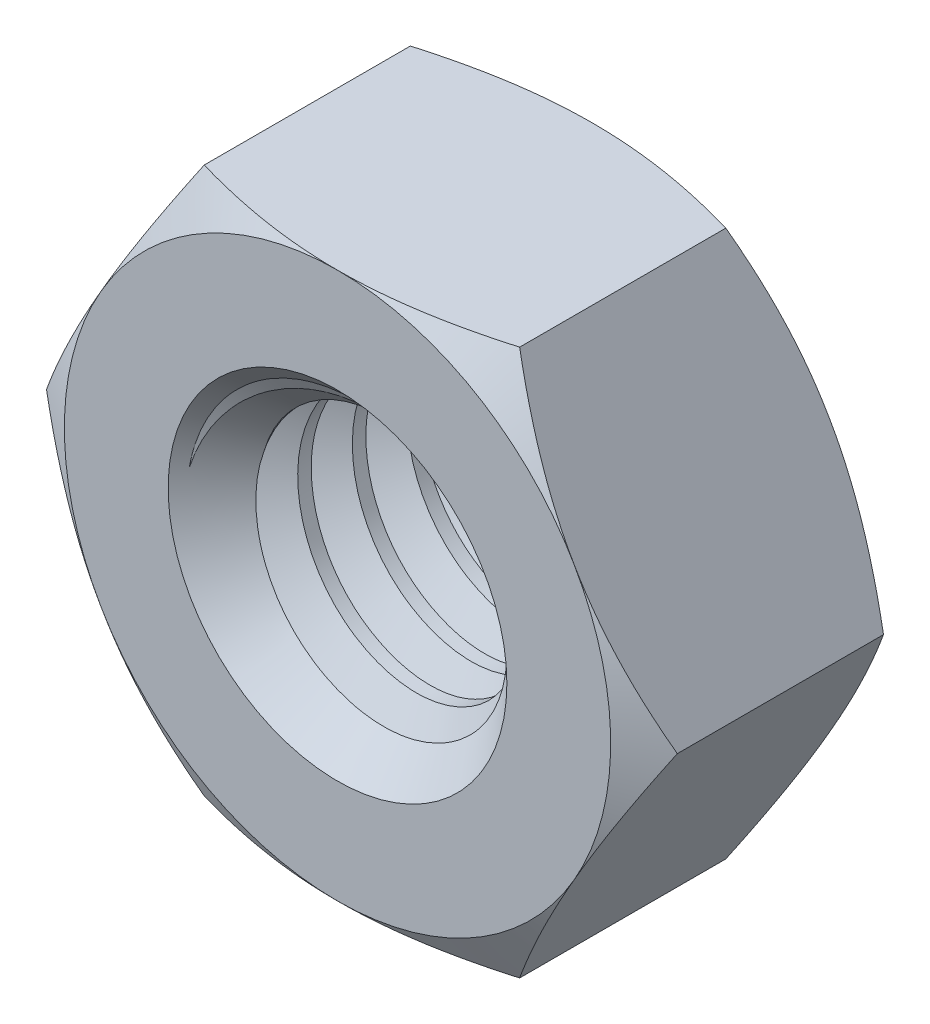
ISO-10303-21;
HEADER;
FILE_DESCRIPTION(('STEP AP214'),'2;1');
FILE_NAME('part.step','',(''),(''),'','','');
FILE_SCHEMA(('AUTOMOTIVE_DESIGN { 1 0 10303 214 1 1 1 1 }'));
ENDSEC;
DATA;
#1=APPLICATION_CONTEXT('core data for automotive mechanical design processes');
#2=APPLICATION_PROTOCOL_DEFINITION('international standard','automotive_design',2000,#1);
#3=PRODUCT_CONTEXT('',#1,'mechanical');
#4=PRODUCT('Part','Part','',(#3));
#5=PRODUCT_RELATED_PRODUCT_CATEGORY('part','',(#4));
#6=PRODUCT_DEFINITION_FORMATION('','',#4);
#7=PRODUCT_DEFINITION_CONTEXT('part definition',#1,'design');
#8=PRODUCT_DEFINITION('design','',#6,#7);
#9=PRODUCT_DEFINITION_SHAPE('','',#8);
#10=(LENGTH_UNIT() NAMED_UNIT(*) SI_UNIT(.MILLI.,.METRE.));
#11=(NAMED_UNIT(*) PLANE_ANGLE_UNIT() SI_UNIT($,.RADIAN.));
#12=(NAMED_UNIT(*) SI_UNIT($,.STERADIAN.) SOLID_ANGLE_UNIT());
#13=UNCERTAINTY_MEASURE_WITH_UNIT(LENGTH_MEASURE(1.E-05),#10,'distance_accuracy_value','');
#14=(GEOMETRIC_REPRESENTATION_CONTEXT(3) GLOBAL_UNCERTAINTY_ASSIGNED_CONTEXT((#13)) GLOBAL_UNIT_ASSIGNED_CONTEXT((#10,
#11,#12)) REPRESENTATION_CONTEXT('',''));
#15=CARTESIAN_POINT('',(0.,0.,0.));
#16=DIRECTION('',(0.,0.,1.));
#17=DIRECTION('',(1.,0.,0.));
#18=AXIS2_PLACEMENT_3D('',#15,#16,#17);
#19=CARTESIAN_POINT('',(0.,0.,2.8));
#20=DIRECTION('',(0.,0.,-1.));
#21=DIRECTION('',(-1.,0.,0.));
#22=AXIS2_PLACEMENT_3D('',#19,#20,#21);
#23=CYLINDRICAL_SURFACE('',#22,1.36);
#24=CARTESIAN_POINT('',(1.35990850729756,0.0157750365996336,-0.22466628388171));
#25=CARTESIAN_POINT('',(1.35080078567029,0.800918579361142,-0.17466628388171));
#26=CARTESIAN_POINT('',(0.666292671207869,1.18560283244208,-0.12466628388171));
#27=CARTESIAN_POINT('',(-0.0182154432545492,1.57028708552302,-0.0746662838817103));
#28=CARTESIAN_POINT('',(-0.693615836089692,1.16982779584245,-0.0246662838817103));
#29=CARTESIAN_POINT('',(-1.36901622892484,0.769368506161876,0.0253337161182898));
#30=CARTESIAN_POINT('',(-1.35990850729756,-0.0157750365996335,0.0753337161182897));
#31=CARTESIAN_POINT('',(-1.35080078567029,-0.800918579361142,0.12533371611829));
#32=CARTESIAN_POINT('',(-0.666292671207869,-1.18560283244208,0.17533371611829));
#33=CARTESIAN_POINT('',(0.0182154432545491,-1.57028708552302,0.22533371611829));
#34=CARTESIAN_POINT('',(0.693615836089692,-1.16982779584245,0.27533371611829));
#35=CARTESIAN_POINT('',(1.36901622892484,-0.769368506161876,0.32533371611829));
#36=CARTESIAN_POINT('',(1.35990850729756,0.0157750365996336,0.37533371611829));
#37=CARTESIAN_POINT('',(1.35080078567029,0.800918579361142,0.42533371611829));
#38=CARTESIAN_POINT('',(0.666292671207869,1.18560283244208,0.47533371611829));
#39=CARTESIAN_POINT('',(-0.0182154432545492,1.57028708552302,0.52533371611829));
#40=CARTESIAN_POINT('',(-0.693615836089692,1.16982779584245,0.57533371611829));
#41=CARTESIAN_POINT('',(-1.36901622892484,0.769368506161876,0.62533371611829));
#42=CARTESIAN_POINT('',(-1.35990850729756,-0.0157750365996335,0.67533371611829));
#43=CARTESIAN_POINT('',(-1.35080078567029,-0.800918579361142,0.72533371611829));
#44=CARTESIAN_POINT('',(-0.666292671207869,-1.18560283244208,0.77533371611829));
#45=CARTESIAN_POINT('',(0.0182154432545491,-1.57028708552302,0.82533371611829));
#46=CARTESIAN_POINT('',(0.693615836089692,-1.16982779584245,0.875333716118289));
#47=CARTESIAN_POINT('',(1.36901622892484,-0.769368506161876,0.92533371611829));
#48=CARTESIAN_POINT('',(1.35990850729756,0.0157750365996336,0.97533371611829));
#49=CARTESIAN_POINT('',(1.35080078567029,0.800918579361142,1.02533371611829));
#50=CARTESIAN_POINT('',(0.666292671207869,1.18560283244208,1.07533371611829));
#51=CARTESIAN_POINT('',(-0.0182154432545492,1.57028708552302,1.12533371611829));
#52=CARTESIAN_POINT('',(-0.693615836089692,1.16982779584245,1.17533371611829));
#53=CARTESIAN_POINT('',(-1.36901622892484,0.769368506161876,1.22533371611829));
#54=CARTESIAN_POINT('',(-1.35990850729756,-0.0157750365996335,1.27533371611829));
#55=CARTESIAN_POINT('',(-1.35080078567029,-0.800918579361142,1.32533371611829));
#56=CARTESIAN_POINT('',(-0.666292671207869,-1.18560283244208,1.37533371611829));
#57=CARTESIAN_POINT('',(0.0182154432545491,-1.57028708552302,1.42533371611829));
#58=CARTESIAN_POINT('',(0.693615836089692,-1.16982779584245,1.47533371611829));
#59=CARTESIAN_POINT('',(1.36901622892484,-0.769368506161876,1.52533371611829));
#60=CARTESIAN_POINT('',(1.35990850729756,0.0157750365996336,1.57533371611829));
#61=CARTESIAN_POINT('',(1.35080078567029,0.800918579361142,1.62533371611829));
#62=CARTESIAN_POINT('',(0.666292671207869,1.18560283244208,1.67533371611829));
#63=CARTESIAN_POINT('',(-0.0182154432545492,1.57028708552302,1.72533371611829));
#64=CARTESIAN_POINT('',(-0.693615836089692,1.16982779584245,1.77533371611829));
#65=CARTESIAN_POINT('',(-1.36901622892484,0.769368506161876,1.82533371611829));
#66=CARTESIAN_POINT('',(-1.35990850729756,-0.0157750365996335,1.87533371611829));
#67=CARTESIAN_POINT('',(-1.35080078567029,-0.800918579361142,1.92533371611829));
#68=CARTESIAN_POINT('',(-0.666292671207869,-1.18560283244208,1.97533371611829));
#69=CARTESIAN_POINT('',(0.0182154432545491,-1.57028708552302,2.02533371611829));
#70=CARTESIAN_POINT('',(0.693615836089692,-1.16982779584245,2.07533371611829));
#71=CARTESIAN_POINT('',(1.36901622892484,-0.769368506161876,2.12533371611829));
#72=CARTESIAN_POINT('',(1.35990850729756,0.0157750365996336,2.17533371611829));
#73=CARTESIAN_POINT('',(1.35080078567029,0.800918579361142,2.22533371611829));
#74=CARTESIAN_POINT('',(0.666292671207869,1.18560283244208,2.27533371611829));
#75=CARTESIAN_POINT('',(-0.0182154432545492,1.57028708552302,2.32533371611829));
#76=CARTESIAN_POINT('',(-0.693615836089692,1.16982779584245,2.37533371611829));
#77=CARTESIAN_POINT('',(-1.36901622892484,0.769368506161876,2.42533371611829));
#78=CARTESIAN_POINT('',(-1.35990850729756,-0.0157750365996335,2.47533371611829));
#79=CARTESIAN_POINT('',(-1.35080078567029,-0.800918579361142,2.52533371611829));
#80=CARTESIAN_POINT('',(-0.666292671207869,-1.18560283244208,2.57533371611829));
#81=CARTESIAN_POINT('',(0.0182154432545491,-1.57028708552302,2.62533371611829));
#82=CARTESIAN_POINT('',(0.693615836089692,-1.16982779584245,2.67533371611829));
#83=CARTESIAN_POINT('',(1.36901622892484,-0.769368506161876,2.72533371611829));
#84=CARTESIAN_POINT('',(1.35990850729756,0.0157750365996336,2.77533371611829));
#85=CARTESIAN_POINT('',(1.35080078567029,0.800918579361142,2.82533371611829));
#86=CARTESIAN_POINT('',(0.666292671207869,1.18560283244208,2.87533371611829));
#87=CARTESIAN_POINT('',(-0.0182154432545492,1.57028708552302,2.92533371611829));
#88=CARTESIAN_POINT('',(-0.693615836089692,1.16982779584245,2.97533371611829));
#89=CARTESIAN_POINT('',(-1.36901622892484,0.769368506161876,3.02533371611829));
#90=CARTESIAN_POINT('',(-1.35990850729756,-0.0157750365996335,3.07533371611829));
#91=CARTESIAN_POINT('',(-1.35080078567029,-0.800918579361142,3.12533371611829));
#92=CARTESIAN_POINT('',(-0.666292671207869,-1.18560283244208,3.17533371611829));
#93=CARTESIAN_POINT('',(0.0182154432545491,-1.57028708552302,3.22533371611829));
#94=CARTESIAN_POINT('',(0.693615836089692,-1.16982779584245,3.27533371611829));
#95=CARTESIAN_POINT('',(1.36901622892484,-0.769368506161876,3.32533371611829));
#96=CARTESIAN_POINT('',(1.35990850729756,0.0157750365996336,3.37533371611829));
#97=CARTESIAN_POINT('',(1.35080078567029,0.800918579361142,3.42533371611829));
#98=CARTESIAN_POINT('',(0.666292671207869,1.18560283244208,3.47533371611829));
#99=CARTESIAN_POINT('',(-0.0182154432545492,1.57028708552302,3.52533371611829));
#100=CARTESIAN_POINT('',(-0.693615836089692,1.16982779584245,3.57533371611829));
#101=CARTESIAN_POINT('',(-1.36901622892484,0.769368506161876,3.62533371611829));
#102=CARTESIAN_POINT('',(-1.35990850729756,-0.0157750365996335,3.67533371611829));
#103=CARTESIAN_POINT('',(-1.35080078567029,-0.800918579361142,3.72533371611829));
#104=CARTESIAN_POINT('',(-0.666292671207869,-1.18560283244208,3.77533371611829));
#105=(BOUNDED_CURVE() B_SPLINE_CURVE(2,(#24,#25,#26,#27,#28,#29,#30,#31,#32,#33,#34,#35,#36,#37,
#38,#39,#40,#41,#42,#43,#44,#45,#46,#47,#48,#49,#50,#51,#52,#53,#54,#55,#56,#57,#58,#59,#60,#61,
#62,#63,#64,#65,#66,#67,#68,#69,#70,#71,#72,#73,#74,#75,#76,#77,#78,#79,#80,#81,#82,#83,#84,#85,
#86,#87,#88,#89,#90,#91,#92,#93,#94,#95,#96,#97,#98,#99,#100,#101,#102,#103,#104),.UNSPECIFIED.,
.F.,.F.) B_SPLINE_CURVE_WITH_KNOTS((3,2,2,2,2,2,2,2,2,2,2,2,2,2,2,2,2,2,2,2,2,2,2,2,2,2,2,2,2,2,
2,2,2,2,2,2,2,2,2,2,3),(0.,0.0238095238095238,0.0476190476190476,0.0714285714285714,
0.0952380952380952,0.119047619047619,0.142857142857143,0.166666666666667,0.19047619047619,
0.214285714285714,0.238095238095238,0.261904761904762,0.285714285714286,0.30952380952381,
0.333333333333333,0.357142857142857,0.380952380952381,0.404761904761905,0.428571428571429,
0.452380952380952,0.476190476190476,0.5,0.523809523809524,0.547619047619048,0.571428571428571,
0.595238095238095,0.619047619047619,0.642857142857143,0.666666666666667,0.69047619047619,
0.714285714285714,0.738095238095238,0.761904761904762,0.785714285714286,0.80952380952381,
0.833333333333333,0.857142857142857,0.880952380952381,0.904761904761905,0.928571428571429,
0.952380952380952),
.UNSPECIFIED.) CURVE() GEOMETRIC_REPRESENTATION_ITEM() RATIONAL_B_SPLINE_CURVE((1.,
0.866025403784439,1.,0.866025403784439,1.,0.866025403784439,1.,0.866025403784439,1.,
0.866025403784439,1.,0.866025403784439,1.,0.866025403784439,1.,0.866025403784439,1.,
0.866025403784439,1.,0.866025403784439,1.,0.866025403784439,1.,0.866025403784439,1.,
0.866025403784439,1.,0.866025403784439,1.,0.866025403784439,1.,0.866025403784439,1.,
0.866025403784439,1.,0.866025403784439,1.,0.866025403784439,1.,0.866025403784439,1.,
0.866025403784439,1.,0.866025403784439,1.,0.866025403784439,1.,0.866025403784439,1.,
0.866025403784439,1.,0.866025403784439,1.,0.866025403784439,1.,0.866025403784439,1.,
0.866025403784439,1.,0.866025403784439,1.,0.866025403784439,1.,0.866025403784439,1.,
0.866025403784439,1.,0.866025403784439,1.,0.866025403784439,1.,0.866025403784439,1.,
0.866025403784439,1.,0.866025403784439,1.,0.866025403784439,1.,0.866025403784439,1.)) REPRESENTATION_ITEM(''));
#106=CARTESIAN_POINT('',(0.329254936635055,1.31954203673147,2.3));
#107=VERTEX_POINT('',#106);
#108=CARTESIAN_POINT('',(0.32925493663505,1.31954203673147,0.499999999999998));
#109=VERTEX_POINT('',#108);
#110=EDGE_CURVE('E157',#107,#109,#105,.F.);
#111=ORIENTED_EDGE('',*,*,#110,.F.);
#112=CARTESIAN_POINT('',(0.,0.,2.3));
#113=DIRECTION('',(0.,0.,1.));
#114=DIRECTION('',(1.,0.,0.));
#115=AXIS2_PLACEMENT_3D('',#112,#113,#114);
#116=CIRCLE('',#115,1.36);
#117=CARTESIAN_POINT('',(-1.30738439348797,0.374627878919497,2.3));
#118=VERTEX_POINT('',#117);
#119=EDGE_CURVE('E168',#107,#118,#116,.T.);
#120=ORIENTED_EDGE('',*,*,#119,.T.);
#121=CARTESIAN_POINT('',(1.35990850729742,-0.0157750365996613,0.224666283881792));
#122=CARTESIAN_POINT('',(1.36901622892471,0.769368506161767,0.274666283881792));
#123=CARTESIAN_POINT('',(0.693615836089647,1.16982779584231,0.324666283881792));
#124=CARTESIAN_POINT('',(0.0182154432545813,1.57028708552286,0.374666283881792));
#125=CARTESIAN_POINT('',(-0.666292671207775,1.18560283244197,0.424666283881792));
#126=CARTESIAN_POINT('',(-1.35080078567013,0.80091857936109,0.474666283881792));
#127=CARTESIAN_POINT('',(-1.35990850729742,0.0157750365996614,0.524666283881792));
#128=CARTESIAN_POINT('',(-1.36901622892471,-0.769368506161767,0.574666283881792));
#129=CARTESIAN_POINT('',(-0.693615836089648,-1.16982779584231,0.624666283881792));
#130=CARTESIAN_POINT('',(-0.0182154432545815,-1.57028708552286,0.674666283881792));
#131=CARTESIAN_POINT('',(0.666292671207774,-1.18560283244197,0.724666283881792));
#132=CARTESIAN_POINT('',(1.35080078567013,-0.800918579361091,0.774666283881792));
#133=CARTESIAN_POINT('',(1.35990850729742,-0.0157750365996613,0.824666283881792));
#134=CARTESIAN_POINT('',(1.36901622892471,0.769368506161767,0.874666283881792));
#135=CARTESIAN_POINT('',(0.693615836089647,1.16982779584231,0.924666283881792));
#136=CARTESIAN_POINT('',(0.0182154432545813,1.57028708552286,0.974666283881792));
#137=CARTESIAN_POINT('',(-0.666292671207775,1.18560283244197,1.02466628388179));
#138=CARTESIAN_POINT('',(-1.35080078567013,0.80091857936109,1.07466628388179));
#139=CARTESIAN_POINT('',(-1.35990850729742,0.0157750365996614,1.12466628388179));
#140=CARTESIAN_POINT('',(-1.36901622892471,-0.769368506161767,1.17466628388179));
#141=CARTESIAN_POINT('',(-0.693615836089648,-1.16982779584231,1.22466628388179));
#142=CARTESIAN_POINT('',(-0.0182154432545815,-1.57028708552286,1.27466628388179));
#143=CARTESIAN_POINT('',(0.666292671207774,-1.18560283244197,1.32466628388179));
#144=CARTESIAN_POINT('',(1.35080078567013,-0.800918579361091,1.37466628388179));
#145=CARTESIAN_POINT('',(1.35990850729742,-0.0157750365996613,1.42466628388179));
#146=CARTESIAN_POINT('',(1.36901622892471,0.769368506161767,1.47466628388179));
#147=CARTESIAN_POINT('',(0.693615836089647,1.16982779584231,1.52466628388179));
#148=CARTESIAN_POINT('',(0.0182154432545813,1.57028708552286,1.57466628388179));
#149=CARTESIAN_POINT('',(-0.666292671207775,1.18560283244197,1.62466628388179));
#150=CARTESIAN_POINT('',(-1.35080078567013,0.80091857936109,1.67466628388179));
#151=CARTESIAN_POINT('',(-1.35990850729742,0.0157750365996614,1.72466628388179));
#152=CARTESIAN_POINT('',(-1.36901622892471,-0.769368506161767,1.77466628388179));
#153=CARTESIAN_POINT('',(-0.693615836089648,-1.16982779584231,1.82466628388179));
#154=CARTESIAN_POINT('',(-0.0182154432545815,-1.57028708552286,1.87466628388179));
#155=CARTESIAN_POINT('',(0.666292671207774,-1.18560283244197,1.92466628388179));
#156=CARTESIAN_POINT('',(1.35080078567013,-0.800918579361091,1.97466628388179));
#157=CARTESIAN_POINT('',(1.35990850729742,-0.0157750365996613,2.02466628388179));
#158=CARTESIAN_POINT('',(1.36901622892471,0.769368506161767,2.07466628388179));
#159=CARTESIAN_POINT('',(0.693615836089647,1.16982779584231,2.12466628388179));
#160=CARTESIAN_POINT('',(0.0182154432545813,1.57028708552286,2.17466628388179));
#161=CARTESIAN_POINT('',(-0.666292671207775,1.18560283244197,2.22466628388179));
#162=CARTESIAN_POINT('',(-1.35080078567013,0.80091857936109,2.27466628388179));
#163=CARTESIAN_POINT('',(-1.35990850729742,0.0157750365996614,2.32466628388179));
#164=CARTESIAN_POINT('',(-1.36901622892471,-0.769368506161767,2.37466628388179));
#165=CARTESIAN_POINT('',(-0.693615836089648,-1.16982779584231,2.42466628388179));
#166=CARTESIAN_POINT('',(-0.0182154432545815,-1.57028708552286,2.47466628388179));
#167=CARTESIAN_POINT('',(0.666292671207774,-1.18560283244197,2.52466628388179));
#168=CARTESIAN_POINT('',(1.35080078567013,-0.800918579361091,2.57466628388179));
#169=CARTESIAN_POINT('',(1.35990850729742,-0.0157750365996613,2.62466628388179));
#170=CARTESIAN_POINT('',(1.36901622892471,0.769368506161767,2.67466628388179));
#171=CARTESIAN_POINT('',(0.693615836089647,1.16982779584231,2.72466628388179));
#172=CARTESIAN_POINT('',(0.0182154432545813,1.57028708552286,2.77466628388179));
#173=CARTESIAN_POINT('',(-0.666292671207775,1.18560283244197,2.82466628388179));
#174=CARTESIAN_POINT('',(-1.35080078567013,0.80091857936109,2.87466628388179));
#175=CARTESIAN_POINT('',(-1.35990850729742,0.0157750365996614,2.92466628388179));
#176=CARTESIAN_POINT('',(-1.36901622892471,-0.769368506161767,2.97466628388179));
#177=CARTESIAN_POINT('',(-0.693615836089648,-1.16982779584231,3.02466628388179));
#178=CARTESIAN_POINT('',(-0.0182154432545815,-1.57028708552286,3.07466628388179));
#179=CARTESIAN_POINT('',(0.666292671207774,-1.18560283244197,3.12466628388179));
#180=CARTESIAN_POINT('',(1.35080078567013,-0.800918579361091,3.17466628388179));
#181=CARTESIAN_POINT('',(1.35990850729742,-0.0157750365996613,3.22466628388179));
#182=CARTESIAN_POINT('',(1.36901622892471,0.769368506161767,3.27466628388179));
#183=CARTESIAN_POINT('',(0.693615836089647,1.16982779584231,3.32466628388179));
#184=CARTESIAN_POINT('',(0.0182154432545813,1.57028708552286,3.37466628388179));
#185=CARTESIAN_POINT('',(-0.666292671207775,1.18560283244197,3.42466628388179));
#186=CARTESIAN_POINT('',(-1.35080078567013,0.80091857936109,3.47466628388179));
#187=CARTESIAN_POINT('',(-1.35990850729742,0.0157750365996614,3.52466628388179));
#188=CARTESIAN_POINT('',(-1.36901622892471,-0.769368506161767,3.57466628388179));
#189=CARTESIAN_POINT('',(-0.693615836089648,-1.16982779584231,3.62466628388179));
#190=CARTESIAN_POINT('',(-0.0182154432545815,-1.57028708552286,3.67466628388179));
#191=CARTESIAN_POINT('',(0.666292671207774,-1.18560283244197,3.72466628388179));
#192=CARTESIAN_POINT('',(1.35080078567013,-0.800918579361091,3.77466628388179));
#193=CARTESIAN_POINT('',(1.35990850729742,-0.0157750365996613,3.82466628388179));
#194=CARTESIAN_POINT('',(1.36901622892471,0.769368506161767,3.87466628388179));
#195=CARTESIAN_POINT('',(0.693615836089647,1.16982779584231,3.92466628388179));
#196=CARTESIAN_POINT('',(0.0182154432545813,1.57028708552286,3.97466628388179));
#197=CARTESIAN_POINT('',(-0.666292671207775,1.18560283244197,4.02466628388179));
#198=CARTESIAN_POINT('',(-1.35080078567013,0.80091857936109,4.07466628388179));
#199=CARTESIAN_POINT('',(-1.35990850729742,0.0157750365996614,4.12466628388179));
#200=CARTESIAN_POINT('',(-1.36901622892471,-0.769368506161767,4.17466628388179));
#201=CARTESIAN_POINT('',(-0.693615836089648,-1.16982779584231,4.22466628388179));
#202=(BOUNDED_CURVE() B_SPLINE_CURVE(2,(#121,#122,#123,#124,#125,#126,#127,#128,#129,#130,#131,
#132,#133,#134,#135,#136,#137,#138,#139,#140,#141,#142,#143,#144,#145,#146,#147,#148,#149,#150,
#151,#152,#153,#154,#155,#156,#157,#158,#159,#160,#161,#162,#163,#164,#165,#166,#167,#168,#169,
#170,#171,#172,#173,#174,#175,#176,#177,#178,#179,#180,#181,#182,#183,#184,#185,#186,#187,#188,
#189,#190,#191,#192,#193,#194,#195,#196,#197,#198,#199,#200,#201),.UNSPECIFIED.,.F.,
.F.) B_SPLINE_CURVE_WITH_KNOTS((3,2,2,2,2,2,2,2,2,2,2,2,2,2,2,2,2,2,2,2,2,2,2,2,2,2,2,2,2,2,2,2,
2,2,2,2,2,2,2,2,3),(0.,0.0238095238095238,0.0476190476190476,0.0714285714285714,
0.0952380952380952,0.119047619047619,0.142857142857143,0.166666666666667,0.19047619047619,
0.214285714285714,0.238095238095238,0.261904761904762,0.285714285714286,0.30952380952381,
0.333333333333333,0.357142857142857,0.380952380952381,0.404761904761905,0.428571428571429,
0.452380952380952,0.476190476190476,0.5,0.523809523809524,0.547619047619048,0.571428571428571,
0.595238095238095,0.619047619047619,0.642857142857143,0.666666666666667,0.69047619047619,
0.714285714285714,0.738095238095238,0.761904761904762,0.785714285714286,0.80952380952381,
0.833333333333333,0.857142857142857,0.880952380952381,0.904761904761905,0.928571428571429,
0.952380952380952),
.UNSPECIFIED.) CURVE() GEOMETRIC_REPRESENTATION_ITEM() RATIONAL_B_SPLINE_CURVE((1.,
0.866025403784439,1.,0.866025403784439,1.,0.866025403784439,1.,0.866025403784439,1.,
0.866025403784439,1.,0.866025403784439,1.,0.866025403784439,1.,0.866025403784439,1.,
0.866025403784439,1.,0.866025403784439,1.,0.866025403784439,1.,0.866025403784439,1.,
0.866025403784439,1.,0.866025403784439,1.,0.866025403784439,1.,0.866025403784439,1.,
0.866025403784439,1.,0.866025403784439,1.,0.866025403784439,1.,0.866025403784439,1.,
0.866025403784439,1.,0.866025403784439,1.,0.866025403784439,1.,0.866025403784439,1.,
0.866025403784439,1.,0.866025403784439,1.,0.866025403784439,1.,0.866025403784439,1.,
0.866025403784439,1.,0.866025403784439,1.,0.866025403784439,1.,0.866025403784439,1.,
0.866025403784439,1.,0.866025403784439,1.,0.866025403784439,1.,0.866025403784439,1.,
0.866025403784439,1.,0.866025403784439,1.,0.866025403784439,1.,0.866025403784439,1.)) REPRESENTATION_ITEM(''));
#203=CARTESIAN_POINT('',(-1.30738439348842,0.37462787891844,0.499999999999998));
#204=VERTEX_POINT('',#203);
#205=EDGE_CURVE('E152',#204,#118,#202,.T.);
#206=ORIENTED_EDGE('',*,*,#205,.F.);
#207=CARTESIAN_POINT('',(0.,0.,0.499999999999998));
#208=DIRECTION('',(0.,0.,1.));
#209=DIRECTION('',(1.,0.,0.));
#210=AXIS2_PLACEMENT_3D('',#207,#208,#209);
#211=CIRCLE('',#210,1.36);
#212=EDGE_CURVE('E353',#204,#109,#211,.F.);
#213=ORIENTED_EDGE('',*,*,#212,.T.);
#214=EDGE_LOOP('',(#111,#120,#206,#213));
#215=FACE_BOUND('',#214,.T.);
#216=ADVANCED_FACE('F38',(#215),#23,.F.);
#217=CARTESIAN_POINT('',(1.73205080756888,-3.,2.8));
#218=DIRECTION('',(-0.866025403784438,0.5,0.));
#219=DIRECTION('',(-0.5,-0.866025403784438,0.));
#220=AXIS2_PLACEMENT_3D('',#217,#218,#219);
#221=PLANE('',#220);
#222=CARTESIAN_POINT('',(3.46421708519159,0.000199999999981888,0.268015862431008));
#223=CARTESIAN_POINT('',(3.38810199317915,-0.13163520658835,0.224053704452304));
#224=CARTESIAN_POINT('',(3.31132988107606,-0.264608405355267,0.184071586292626));
#225=CARTESIAN_POINT('',(3.15645624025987,-0.532857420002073,0.114282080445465));
#226=CARTESIAN_POINT('',(3.07835195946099,-0.668138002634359,0.0844993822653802));
#227=CARTESIAN_POINT('',(2.92311136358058,-0.9370226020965,0.0381378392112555));
#228=CARTESIAN_POINT('',(2.84599893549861,-1.07058524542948,0.0212504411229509));
#229=CARTESIAN_POINT('',(2.69141120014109,-1.33833905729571,0.00108964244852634));
#230=CARTESIAN_POINT('',(2.61393645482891,-1.47252925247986,-0.00220045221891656));
#231=CARTESIAN_POINT('',(2.46916798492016,-1.72327559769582,0.00464053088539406));
#232=CARTESIAN_POINT('',(2.40185259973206,-1.83986926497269,0.0130919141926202));
#233=CARTESIAN_POINT('',(2.2676603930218,-2.07229698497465,0.0398789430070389));
#234=CARTESIAN_POINT('',(2.2007840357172,-2.18813023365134,0.0582237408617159));
#235=CARTESIAN_POINT('',(2.06631510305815,-2.42103725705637,0.10408475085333));
#236=CARTESIAN_POINT('',(1.99873954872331,-2.53808155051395,0.131795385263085));
#237=CARTESIAN_POINT('',(1.86459637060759,-2.77042435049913,0.194687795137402));
#238=CARTESIAN_POINT('',(1.79802702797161,-2.88572583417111,0.229854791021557));
#239=CARTESIAN_POINT('',(1.73193533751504,-3.0002,0.268015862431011));
#240=B_SPLINE_CURVE_WITH_KNOTS('',3,(#222,#223,#224,#225,#226,#227,#228,#229,#230,#231,#232,
#233,#234,#235,#236,#237,#238,#239),.UNSPECIFIED.,.F.,.F.,(4,2,2,2,2,2,2,2,4),(0.,
0.47553983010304,0.952222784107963,1.41710776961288,1.88142182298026,2.2857243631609,
2.69040156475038,3.10405572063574,3.51689749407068),.UNSPECIFIED.);
#241=CARTESIAN_POINT('',(3.46410161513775,0.,0.267949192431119));
#242=VERTEX_POINT('',#241);
#243=CARTESIAN_POINT('',(2.59807621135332,-1.5,0.));
#244=VERTEX_POINT('',#243);
#245=EDGE_CURVE('E321',#242,#244,#240,.T.);
#246=ORIENTED_EDGE('',*,*,#245,.F.);
#247=DIRECTION('',(0.,0.,-1.));
#248=VECTOR('',#247,1.);
#249=CARTESIAN_POINT('',(3.46410161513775,0.,2.8));
#250=LINE('',#249,#248);
#251=CARTESIAN_POINT('',(3.46410161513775,0.,2.53205080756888));
#252=VERTEX_POINT('',#251);
#253=EDGE_CURVE('E324',#252,#242,#250,.T.);
#254=ORIENTED_EDGE('',*,*,#253,.F.);
#255=CARTESIAN_POINT('',(1.73193533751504,-3.0002,2.53198413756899));
#256=CARTESIAN_POINT('',(1.80805042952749,-2.86836479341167,2.57594629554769));
#257=CARTESIAN_POINT('',(1.88482254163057,-2.73539159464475,2.61592841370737));
#258=CARTESIAN_POINT('',(2.03969618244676,-2.46714257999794,2.68571791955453));
#259=CARTESIAN_POINT('',(2.11780046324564,-2.33186199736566,2.71550061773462));
#260=CARTESIAN_POINT('',(2.27304105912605,-2.06297739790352,2.76186216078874));
#261=CARTESIAN_POINT('',(2.35015348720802,-1.92941475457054,2.77874955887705));
#262=CARTESIAN_POINT('',(2.50474122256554,-1.66166094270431,2.79891035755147));
#263=CARTESIAN_POINT('',(2.58221596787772,-1.52747074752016,2.80220045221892));
#264=CARTESIAN_POINT('',(2.72698443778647,-1.27672440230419,2.79535946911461));
#265=CARTESIAN_POINT('',(2.79429982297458,-1.16013073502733,2.78690808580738));
#266=CARTESIAN_POINT('',(2.92849202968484,-0.927703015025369,2.76012105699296));
#267=CARTESIAN_POINT('',(2.99536838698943,-0.811869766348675,2.74177625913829));
#268=CARTESIAN_POINT('',(3.12983731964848,-0.578962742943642,2.69591524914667));
#269=CARTESIAN_POINT('',(3.19741287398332,-0.461918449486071,2.66820461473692));
#270=CARTESIAN_POINT('',(3.33155605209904,-0.22957564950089,2.6053122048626));
#271=CARTESIAN_POINT('',(3.39812539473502,-0.11427416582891,2.57014520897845));
#272=CARTESIAN_POINT('',(3.46421708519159,0.000199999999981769,2.53198413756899));
#273=B_SPLINE_CURVE_WITH_KNOTS('',3,(#255,#256,#257,#258,#259,#260,#261,#262,#263,#264,#265,
#266,#267,#268,#269,#270,#271,#272),.UNSPECIFIED.,.F.,.F.,(4,2,2,2,2,2,2,2,4),(0.,
0.475539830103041,0.952222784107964,1.41710776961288,1.88142182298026,2.28572436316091,
2.69040156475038,3.10405572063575,3.51689749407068),.UNSPECIFIED.);
#274=CARTESIAN_POINT('',(2.59807621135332,-1.5,2.8));
#275=VERTEX_POINT('',#274);
#276=EDGE_CURVE('E300',#275,#252,#273,.T.);
#277=ORIENTED_EDGE('',*,*,#276,.F.);
#278=CARTESIAN_POINT('',(1.73205080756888,-3.,2.53205080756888));
#279=VERTEX_POINT('',#278);
#280=EDGE_CURVE('E414',#279,#275,#273,.T.);
#281=ORIENTED_EDGE('',*,*,#280,.F.);
#282=DIRECTION('',(0.,0.,-1.));
#283=VECTOR('',#282,1.);
#284=CARTESIAN_POINT('',(1.73205080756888,-3.,2.8));
#285=LINE('',#284,#283);
#286=CARTESIAN_POINT('',(1.73205080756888,-3.,0.267949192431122));
#287=VERTEX_POINT('',#286);
#288=EDGE_CURVE('E411',#279,#287,#285,.T.);
#289=ORIENTED_EDGE('',*,*,#288,.T.);
#290=EDGE_CURVE('E241',#244,#287,#240,.T.);
#291=ORIENTED_EDGE('',*,*,#290,.F.);
#292=EDGE_LOOP('',(#246,#254,#277,#281,#289,#291));
#293=FACE_BOUND('',#292,.T.);
#294=ADVANCED_FACE('F202',(#293),#221,.F.);
#295=CARTESIAN_POINT('',(3.46410161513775,0.,2.8));
#296=DIRECTION('',(-0.866025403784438,-0.5,0.));
#297=DIRECTION('',(0.5,-0.866025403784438,0.));
#298=AXIS2_PLACEMENT_3D('',#295,#296,#297);
#299=PLANE('',#298);
#300=CARTESIAN_POINT('',(1.73193533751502,3.0002,0.268015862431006));
#301=CARTESIAN_POINT('',(1.80805042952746,2.86836479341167,0.224053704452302));
#302=CARTESIAN_POINT('',(1.88482254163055,2.73539159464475,0.184071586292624));
#303=CARTESIAN_POINT('',(2.03969618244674,2.46714257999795,0.114282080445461));
#304=CARTESIAN_POINT('',(2.11780046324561,2.33186199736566,0.0844993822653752));
#305=CARTESIAN_POINT('',(2.27304105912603,2.06297739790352,0.0381378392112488));
#306=CARTESIAN_POINT('',(2.350153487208,1.92941475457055,0.0212504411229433));
#307=CARTESIAN_POINT('',(2.50474122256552,1.66166094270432,0.00108964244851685));
#308=CARTESIAN_POINT('',(2.58221596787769,1.52747074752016,-0.00220045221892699));
#309=CARTESIAN_POINT('',(2.72698443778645,1.2767244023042,0.00464053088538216));
#310=CARTESIAN_POINT('',(2.79429982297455,1.16013073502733,0.013091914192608));
#311=CARTESIAN_POINT('',(2.92849202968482,0.927703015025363,0.0398789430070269));
#312=CARTESIAN_POINT('',(2.99536838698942,0.811869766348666,0.0582237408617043));
#313=CARTESIAN_POINT('',(3.12983731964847,0.578962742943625,0.10408475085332));
#314=CARTESIAN_POINT('',(3.19741287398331,0.46191844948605,0.131795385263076));
#315=CARTESIAN_POINT('',(3.33155605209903,0.229575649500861,0.194687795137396));
#316=CARTESIAN_POINT('',(3.39812539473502,0.114274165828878,0.229854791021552));
#317=CARTESIAN_POINT('',(3.46421708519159,-0.000200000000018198,0.268015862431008));
#318=B_SPLINE_CURVE_WITH_KNOTS('',3,(#300,#301,#302,#303,#304,#305,#306,#307,#308,#309,#310,
#311,#312,#313,#314,#315,#316,#317),.UNSPECIFIED.,.F.,.F.,(4,2,2,2,2,2,2,2,4),(0.,
0.47553983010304,0.952222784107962,1.41710776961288,1.88142182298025,2.28572436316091,
2.6904015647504,3.10405572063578,3.51689749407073),.UNSPECIFIED.);
#319=CARTESIAN_POINT('',(1.73205080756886,3.,0.267949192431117));
#320=VERTEX_POINT('',#319);
#321=CARTESIAN_POINT('',(2.59807621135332,1.5,0.));
#322=VERTEX_POINT('',#321);
#323=EDGE_CURVE('E425',#320,#322,#318,.T.);
#324=ORIENTED_EDGE('',*,*,#323,.F.);
#325=DIRECTION('',(0.,0.,-1.));
#326=VECTOR('',#325,1.);
#327=CARTESIAN_POINT('',(1.73205080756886,3.,2.8));
#328=LINE('',#327,#326);
#329=CARTESIAN_POINT('',(1.73205080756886,3.,2.53205080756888));
#330=VERTEX_POINT('',#329);
#331=EDGE_CURVE('E335',#330,#320,#328,.T.);
#332=ORIENTED_EDGE('',*,*,#331,.F.);
#333=CARTESIAN_POINT('',(3.46421708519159,-0.000200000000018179,2.53198413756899));
#334=CARTESIAN_POINT('',(3.38810199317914,0.131635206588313,2.5759462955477));
#335=CARTESIAN_POINT('',(3.31132988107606,0.26460840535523,2.61592841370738));
#336=CARTESIAN_POINT('',(3.15645624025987,0.532857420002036,2.68571791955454));
#337=CARTESIAN_POINT('',(3.07835195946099,0.668138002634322,2.71550061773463));
#338=CARTESIAN_POINT('',(2.92311136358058,0.937022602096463,2.76186216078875));
#339=CARTESIAN_POINT('',(2.84599893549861,1.07058524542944,2.77874955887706));
#340=CARTESIAN_POINT('',(2.69141120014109,1.33833905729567,2.79891035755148));
#341=CARTESIAN_POINT('',(2.61393645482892,1.47252925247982,2.80220045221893));
#342=CARTESIAN_POINT('',(2.46916798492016,1.72327559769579,2.79535946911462));
#343=CARTESIAN_POINT('',(2.40185259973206,1.83986926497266,2.78690808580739));
#344=CARTESIAN_POINT('',(2.26766039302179,2.07229698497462,2.76012105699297));
#345=CARTESIAN_POINT('',(2.20078403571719,2.18813023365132,2.7417762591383));
#346=CARTESIAN_POINT('',(2.06631510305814,2.42103725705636,2.69591524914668));
#347=CARTESIAN_POINT('',(1.9987395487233,2.53808155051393,2.66820461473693));
#348=CARTESIAN_POINT('',(1.86459637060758,2.77042435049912,2.60531220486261));
#349=CARTESIAN_POINT('',(1.79802702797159,2.88572583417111,2.57014520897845));
#350=CARTESIAN_POINT('',(1.73193533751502,3.0002,2.531984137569));
#351=B_SPLINE_CURVE_WITH_KNOTS('',3,(#333,#334,#335,#336,#337,#338,#339,#340,#341,#342,#343,
#344,#345,#346,#347,#348,#349,#350),.UNSPECIFIED.,.F.,.F.,(4,2,2,2,2,2,2,2,4),(0.,
0.47553983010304,0.952222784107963,1.41710776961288,1.88142182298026,2.28572436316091,
2.6904015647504,3.10405572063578,3.51689749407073),.UNSPECIFIED.);
#352=CARTESIAN_POINT('',(2.59807621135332,1.5,2.8));
#353=VERTEX_POINT('',#352);
#354=EDGE_CURVE('E293',#353,#330,#351,.T.);
#355=ORIENTED_EDGE('',*,*,#354,.F.);
#356=EDGE_CURVE('E299',#252,#353,#351,.T.);
#357=ORIENTED_EDGE('',*,*,#356,.F.);
#358=ORIENTED_EDGE('',*,*,#253,.T.);
#359=EDGE_CURVE('E253',#322,#242,#318,.T.);
#360=ORIENTED_EDGE('',*,*,#359,.F.);
#361=EDGE_LOOP('',(#324,#332,#355,#357,#358,#360));
#362=FACE_BOUND('',#361,.T.);
#363=ADVANCED_FACE('F306',(#362),#299,.F.);
#364=CARTESIAN_POINT('',(1.73205080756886,3.,2.8));
#365=DIRECTION('',(0.,-1.,0.));
#366=DIRECTION('',(0.,0.,-1.));
#367=AXIS2_PLACEMENT_3D('',#364,#365,#366);
#368=PLANE('',#367);
#369=CARTESIAN_POINT('',(-4.740627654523,3.,1.50695884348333));
#370=CARTESIAN_POINT('',(-4.60881770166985,3.,1.44266978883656));
#371=CARTESIAN_POINT('',(-4.4767144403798,3.,1.37897224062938));
#372=CARTESIAN_POINT('',(-4.21176561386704,3.,1.25309121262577));
#373=CARTESIAN_POINT('',(-4.07891994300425,3.,1.19090795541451));
#374=CARTESIAN_POINT('',(-3.81168764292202,3.,1.06809238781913));
#375=CARTESIAN_POINT('',(-3.67729660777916,3.,1.00746963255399));
#376=CARTESIAN_POINT('',(-3.40747585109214,3.,0.888590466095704));
#377=CARTESIAN_POINT('',(-3.27204617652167,3.,0.830333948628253));
#378=CARTESIAN_POINT('',(-2.99526806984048,3.,0.714863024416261));
#379=CARTESIAN_POINT('',(-2.85387592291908,3.,0.657752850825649));
#380=CARTESIAN_POINT('',(-2.56947033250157,3.,0.54764531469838));
#381=CARTESIAN_POINT('',(-2.42645671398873,3.,0.494648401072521));
#382=CARTESIAN_POINT('',(-2.13882089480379,3.,0.394094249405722));
#383=CARTESIAN_POINT('',(-1.99420232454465,3.,0.346526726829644));
#384=CARTESIAN_POINT('',(-1.70289248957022,3.,0.258299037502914));
#385=CARTESIAN_POINT('',(-1.55620186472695,3.,0.217636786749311));
#386=CARTESIAN_POINT('',(-1.26148040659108,3.,0.145328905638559));
#387=CARTESIAN_POINT('',(-1.11346233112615,3.,0.113632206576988));
#388=CARTESIAN_POINT('',(-0.815496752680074,3.,0.0609877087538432));
#389=CARTESIAN_POINT('',(-0.665549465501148,3.,0.0400387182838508));
#390=CARTESIAN_POINT('',(-0.366467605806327,3.,0.0108302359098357));
#391=CARTESIAN_POINT('',(-0.217350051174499,3.,0.00240079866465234));
#392=CARTESIAN_POINT('',(0.0810713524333,3.,-0.00150737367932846));
#393=CARTESIAN_POINT('',(0.230375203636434,3.,0.00301404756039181));
#394=CARTESIAN_POINT('',(0.481276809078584,3.,0.0211669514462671));
#395=CARTESIAN_POINT('',(0.583130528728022,3.,0.0314913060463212));
#396=CARTESIAN_POINT('',(0.786144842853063,3.,0.0575706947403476));
#397=CARTESIAN_POINT('',(0.887305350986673,3.,0.0733263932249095));
#398=CARTESIAN_POINT('',(1.18958020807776,3.,0.127917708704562));
#399=CARTESIAN_POINT('',(1.38939084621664,3.,0.174069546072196));
#400=CARTESIAN_POINT('',(1.68834642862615,3.,0.254780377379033));
#401=CARTESIAN_POINT('',(1.78902110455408,3.,0.284001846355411));
#402=CARTESIAN_POINT('',(1.98939420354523,3.,0.345648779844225));
#403=CARTESIAN_POINT('',(2.08909261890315,3.,0.378074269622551));
#404=CARTESIAN_POINT('',(2.2875428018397,3.,0.44559500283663));
#405=CARTESIAN_POINT('',(2.38629481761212,3.,0.48068952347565));
#406=CARTESIAN_POINT('',(2.58296838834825,3.,0.553118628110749));
#407=CARTESIAN_POINT('',(2.68088996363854,3.,0.590453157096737));
#408=CARTESIAN_POINT('',(2.94843229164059,3.,0.695406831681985));
#409=CARTESIAN_POINT('',(3.1173055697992,3.,0.764929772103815));
#410=CARTESIAN_POINT('',(3.45327114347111,3.,0.908168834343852));
#411=CARTESIAN_POINT('',(3.62036322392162,3.,0.981885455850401));
#412=CARTESIAN_POINT('',(3.95317780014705,3.,1.1324990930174));
#413=CARTESIAN_POINT('',(4.11889976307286,3.,1.20939728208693));
#414=CARTESIAN_POINT('',(4.44920465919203,3.,1.36560736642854));
#415=CARTESIAN_POINT('',(4.61378755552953,3.,1.44491933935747));
#416=CARTESIAN_POINT('',(4.94230512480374,3.,1.60555008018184));
#417=CARTESIAN_POINT('',(5.10623828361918,3.,1.68687193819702));
#418=CARTESIAN_POINT('',(5.43335829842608,3.,1.85100464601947));
#419=CARTESIAN_POINT('',(5.5965451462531,3.,1.93381551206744));
#420=CARTESIAN_POINT('',(6.0851198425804,3.,2.18397996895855));
#421=CARTESIAN_POINT('',(6.40960056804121,3.,2.35310429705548));
#422=CARTESIAN_POINT('',(7.02173585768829,3.,2.67593953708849));
#423=CARTESIAN_POINT('',(7.30956102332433,3.,2.82932855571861));
#424=CARTESIAN_POINT('',(7.8842531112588,3.,3.13793572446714));
#425=CARTESIAN_POINT('',(8.17111996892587,3.,3.29315399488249));
#426=CARTESIAN_POINT('',(8.74311850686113,3.,3.60439585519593));
#427=CARTESIAN_POINT('',(9.02825274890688,3.,3.76041474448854));
#428=CARTESIAN_POINT('',(9.5979236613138,3.,4.07348416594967));
#429=CARTESIAN_POINT('',(9.88246037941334,3.,4.23053461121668));
#430=CARTESIAN_POINT('',(10.1667883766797,3.,4.38795970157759));
#431=B_SPLINE_CURVE_WITH_KNOTS('',3,(#369,#370,#371,#372,#373,#374,#375,#376,#377,#378,#379,
#380,#381,#382,#383,#384,#385,#386,#387,#388,#389,#390,#391,#392,#393,#394,#395,#396,#397,#398,
#399,#400,#401,#402,#403,#404,#405,#406,#407,#408,#409,#410,#411,#412,#413,#414,#415,#416,#417,
#418,#419,#420,#421,#422,#423,#424,#425,#426,#427,#428,#429,#430),.UNSPECIFIED.,.F.,.F.,(4,2,2,
2,2,2,2,2,2,2,2,2,2,2,2,2,2,2,2,2,2,2,2,2,2,2,2,2,2,2,4),(0.,0.439962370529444,
0.879989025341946,1.32226543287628,1.76452195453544,2.22194353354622,2.67941496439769,
3.13600492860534,3.59245684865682,4.04625385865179,4.50000054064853,4.94752972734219,
5.39506431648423,5.70204403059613,6.00906130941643,6.62338664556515,6.93784686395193,
7.25230956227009,7.56668740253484,7.88105752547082,8.42884463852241,8.97669715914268,
9.52475356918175,10.072827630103,10.6218043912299,11.1707871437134,12.2684892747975,
13.2469220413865,14.225419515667,15.2005023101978,16.1755039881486),.UNSPECIFIED.);
#432=CARTESIAN_POINT('',(-1.73205080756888,3.,0.267949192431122));
#433=VERTEX_POINT('',#432);
#434=CARTESIAN_POINT('',(0.,3.,0.));
#435=VERTEX_POINT('',#434);
#436=EDGE_CURVE('E66',#433,#435,#431,.T.);
#437=ORIENTED_EDGE('',*,*,#436,.F.);
#438=DIRECTION('',(0.,0.,-1.));
#439=VECTOR('',#438,1.);
#440=CARTESIAN_POINT('',(-1.73205080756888,3.,2.8));
#441=LINE('',#440,#439);
#442=CARTESIAN_POINT('',(-1.73205080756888,3.,2.53205080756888));
#443=VERTEX_POINT('',#442);
#444=EDGE_CURVE('E342',#443,#433,#441,.T.);
#445=ORIENTED_EDGE('',*,*,#444,.F.);
#446=CARTESIAN_POINT('',(-4.740627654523,3.,1.29304115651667));
#447=CARTESIAN_POINT('',(-4.60881770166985,3.,1.35733021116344));
#448=CARTESIAN_POINT('',(-4.4767144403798,3.,1.42102775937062));
#449=CARTESIAN_POINT('',(-4.21176561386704,3.,1.54690878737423));
#450=CARTESIAN_POINT('',(-4.07891994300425,3.,1.6090920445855));
#451=CARTESIAN_POINT('',(-3.81168764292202,3.,1.73190761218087));
#452=CARTESIAN_POINT('',(-3.67729660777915,3.,1.79253036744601));
#453=CARTESIAN_POINT('',(-3.40747585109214,3.,1.9114095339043));
#454=CARTESIAN_POINT('',(-3.27204617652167,3.,1.96966605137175));
#455=CARTESIAN_POINT('',(-2.99526806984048,3.,2.08513697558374));
#456=CARTESIAN_POINT('',(-2.85387592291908,3.,2.14224714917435));
#457=CARTESIAN_POINT('',(-2.56947033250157,3.,2.25235468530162));
#458=CARTESIAN_POINT('',(-2.42645671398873,3.,2.30535159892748));
#459=CARTESIAN_POINT('',(-2.13882089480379,3.,2.40590575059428));
#460=CARTESIAN_POINT('',(-1.99420232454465,3.,2.45347327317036));
#461=CARTESIAN_POINT('',(-1.70289248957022,3.,2.54170096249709));
#462=CARTESIAN_POINT('',(-1.55620186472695,3.,2.58236321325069));
#463=CARTESIAN_POINT('',(-1.26148040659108,3.,2.65467109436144));
#464=CARTESIAN_POINT('',(-1.11346233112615,3.,2.68636779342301));
#465=CARTESIAN_POINT('',(-0.815496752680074,3.,2.73901229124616));
#466=CARTESIAN_POINT('',(-0.665549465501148,3.,2.75996128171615));
#467=CARTESIAN_POINT('',(-0.366467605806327,3.,2.78916976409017));
#468=CARTESIAN_POINT('',(-0.217350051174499,3.,2.79759920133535));
#469=CARTESIAN_POINT('',(0.0810713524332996,3.,2.80150737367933));
#470=CARTESIAN_POINT('',(0.230375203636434,3.,2.79698595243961));
#471=CARTESIAN_POINT('',(0.481276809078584,3.,2.77883304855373));
#472=CARTESIAN_POINT('',(0.583130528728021,3.,2.76850869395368));
#473=CARTESIAN_POINT('',(0.786144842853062,3.,2.74242930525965));
#474=CARTESIAN_POINT('',(0.887305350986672,3.,2.72667360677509));
#475=CARTESIAN_POINT('',(1.18958020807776,3.,2.67208229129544));
#476=CARTESIAN_POINT('',(1.38939084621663,3.,2.62593045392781));
#477=CARTESIAN_POINT('',(1.68834642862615,3.,2.54521962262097));
#478=CARTESIAN_POINT('',(1.78902110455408,3.,2.51599815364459));
#479=CARTESIAN_POINT('',(1.98939420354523,3.,2.45435122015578));
#480=CARTESIAN_POINT('',(2.08909261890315,3.,2.42192573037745));
#481=CARTESIAN_POINT('',(2.28754280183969,3.,2.35440499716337));
#482=CARTESIAN_POINT('',(2.38629481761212,3.,2.31931047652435));
#483=CARTESIAN_POINT('',(2.58296838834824,3.,2.24688137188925));
#484=CARTESIAN_POINT('',(2.68088996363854,3.,2.20954684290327));
#485=CARTESIAN_POINT('',(2.94843229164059,3.,2.10459316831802));
#486=CARTESIAN_POINT('',(3.1173055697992,3.,2.03507022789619));
#487=CARTESIAN_POINT('',(3.45327114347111,3.,1.89183116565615));
#488=CARTESIAN_POINT('',(3.62036322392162,3.,1.8181145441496));
#489=CARTESIAN_POINT('',(3.95317780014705,3.,1.6675009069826));
#490=CARTESIAN_POINT('',(4.11889976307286,3.,1.59060271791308));
#491=CARTESIAN_POINT('',(4.44920465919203,3.,1.43439263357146));
#492=CARTESIAN_POINT('',(4.61378755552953,3.,1.35508066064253));
#493=CARTESIAN_POINT('',(4.94230512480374,3.,1.19444991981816));
#494=CARTESIAN_POINT('',(5.10623828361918,3.,1.11312806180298));
#495=CARTESIAN_POINT('',(5.43335829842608,3.,0.948995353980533));
#496=CARTESIAN_POINT('',(5.5965451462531,3.,0.866184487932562));
#497=CARTESIAN_POINT('',(6.0851198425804,3.,0.616020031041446));
#498=CARTESIAN_POINT('',(6.4096005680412,3.,0.446895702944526));
#499=CARTESIAN_POINT('',(7.02173585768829,3.,0.124060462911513));
#500=CARTESIAN_POINT('',(7.30956102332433,3.,-0.0293285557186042));
#501=CARTESIAN_POINT('',(7.8842531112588,3.,-0.337935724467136));
#502=CARTESIAN_POINT('',(8.17111996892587,3.,-0.493153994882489));
#503=CARTESIAN_POINT('',(8.74311850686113,3.,-0.804395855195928));
#504=CARTESIAN_POINT('',(9.02825274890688,3.,-0.960414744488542));
#505=CARTESIAN_POINT('',(9.59792366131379,3.,-1.27348416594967));
#506=CARTESIAN_POINT('',(9.88246037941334,3.,-1.43053461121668));
#507=CARTESIAN_POINT('',(10.1667883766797,3.,-1.58795970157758));
#508=B_SPLINE_CURVE_WITH_KNOTS('',3,(#446,#447,#448,#449,#450,#451,#452,#453,#454,#455,#456,
#457,#458,#459,#460,#461,#462,#463,#464,#465,#466,#467,#468,#469,#470,#471,#472,#473,#474,#475,
#476,#477,#478,#479,#480,#481,#482,#483,#484,#485,#486,#487,#488,#489,#490,#491,#492,#493,#494,
#495,#496,#497,#498,#499,#500,#501,#502,#503,#504,#505,#506,#507),.UNSPECIFIED.,.F.,.F.,(4,2,2,
2,2,2,2,2,2,2,2,2,2,2,2,2,2,2,2,2,2,2,2,2,2,2,2,2,2,2,4),(0.,0.439962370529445,
0.879989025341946,1.32226543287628,1.76452195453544,2.22194353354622,2.67941496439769,
3.13600492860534,3.59245684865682,4.04625385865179,4.50000054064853,4.94752972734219,
5.39506431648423,5.70204403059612,6.00906130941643,6.62338664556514,6.93784686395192,
7.25230956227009,7.56668740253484,7.88105752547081,8.42884463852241,8.97669715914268,
9.52475356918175,10.072827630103,10.6218043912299,11.1707871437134,12.2684892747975,
13.2469220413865,14.225419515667,15.2005023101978,16.1755039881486),.UNSPECIFIED.);
#509=CARTESIAN_POINT('',(0.,3.,2.8));
#510=VERTEX_POINT('',#509);
#511=EDGE_CURVE('E286',#510,#443,#508,.F.);
#512=ORIENTED_EDGE('',*,*,#511,.F.);
#513=EDGE_CURVE('E292',#330,#510,#508,.F.);
#514=ORIENTED_EDGE('',*,*,#513,.F.);
#515=ORIENTED_EDGE('',*,*,#331,.T.);
#516=EDGE_CURVE('E217',#435,#320,#431,.T.);
#517=ORIENTED_EDGE('',*,*,#516,.F.);
#518=EDGE_LOOP('',(#437,#445,#512,#514,#515,#517));
#519=FACE_BOUND('',#518,.T.);
#520=ADVANCED_FACE('F265',(#519),#368,.F.);
#521=CARTESIAN_POINT('',(-1.73205080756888,3.,2.8));
#522=DIRECTION('',(0.866025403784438,-0.5,0.));
#523=DIRECTION('',(0.5,0.866025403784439,0.));
#524=AXIS2_PLACEMENT_3D('',#521,#522,#523);
#525=PLANE('',#524);
#526=CARTESIAN_POINT('',(-3.46421708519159,-0.000199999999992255,0.268015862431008));
#527=CARTESIAN_POINT('',(-3.38810199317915,0.13163520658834,0.224053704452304));
#528=CARTESIAN_POINT('',(-3.31132988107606,0.264608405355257,0.184071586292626));
#529=CARTESIAN_POINT('',(-3.15645624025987,0.532857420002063,0.114282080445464));
#530=CARTESIAN_POINT('',(-3.078351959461,0.668138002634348,0.0844993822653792));
#531=CARTESIAN_POINT('',(-2.92311136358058,0.93702260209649,0.0381378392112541));
#532=CARTESIAN_POINT('',(-2.84599893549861,1.07058524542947,0.0212504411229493));
#533=CARTESIAN_POINT('',(-2.69141120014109,1.3383390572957,0.00108964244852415));
#534=CARTESIAN_POINT('',(-2.61393645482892,1.47252925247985,-0.00220045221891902));
#535=CARTESIAN_POINT('',(-2.46916798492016,1.72327559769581,0.00464053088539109));
#536=CARTESIAN_POINT('',(-2.40185259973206,1.83986926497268,0.0130919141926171));
#537=CARTESIAN_POINT('',(-2.2676603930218,2.07229698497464,0.0398789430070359));
#538=CARTESIAN_POINT('',(-2.2007840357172,2.18813023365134,0.0582237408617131));
#539=CARTESIAN_POINT('',(-2.06631510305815,2.42103725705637,0.104084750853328));
#540=CARTESIAN_POINT('',(-1.99873954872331,2.53808155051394,0.131795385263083));
#541=CARTESIAN_POINT('',(-1.86459637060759,2.77042435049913,0.194687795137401));
#542=CARTESIAN_POINT('',(-1.79802702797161,2.88572583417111,0.229854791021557));
#543=CARTESIAN_POINT('',(-1.73193533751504,3.0002,0.268015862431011));
#544=B_SPLINE_CURVE_WITH_KNOTS('',3,(#526,#527,#528,#529,#530,#531,#532,#533,#534,#535,#536,
#537,#538,#539,#540,#541,#542,#543),.UNSPECIFIED.,.F.,.F.,(4,2,2,2,2,2,2,2,4),(0.,
0.47553983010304,0.952222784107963,1.41710776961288,1.88142182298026,2.28572436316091,
2.69040156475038,3.10405572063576,3.5168974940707),.UNSPECIFIED.);
#545=CARTESIAN_POINT('',(-3.46410161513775,0.,0.267949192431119));
#546=VERTEX_POINT('',#545);
#547=CARTESIAN_POINT('',(-2.59807621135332,1.5,0.));
#548=VERTEX_POINT('',#547);
#549=EDGE_CURVE('E247',#546,#548,#544,.T.);
#550=ORIENTED_EDGE('',*,*,#549,.F.);
#551=DIRECTION('',(0.,0.,-1.));
#552=VECTOR('',#551,1.);
#553=CARTESIAN_POINT('',(-3.46410161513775,0.,2.8));
#554=LINE('',#553,#552);
#555=CARTESIAN_POINT('',(-3.46410161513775,0.,2.53205080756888));
#556=VERTEX_POINT('',#555);
#557=EDGE_CURVE('E400',#556,#546,#554,.T.);
#558=ORIENTED_EDGE('',*,*,#557,.F.);
#559=CARTESIAN_POINT('',(-1.73193533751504,3.0002,2.53198413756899));
#560=CARTESIAN_POINT('',(-1.80805042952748,2.86836479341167,2.57594629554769));
#561=CARTESIAN_POINT('',(-1.88482254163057,2.73539159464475,2.61592841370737));
#562=CARTESIAN_POINT('',(-2.03969618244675,2.46714257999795,2.68571791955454));
#563=CARTESIAN_POINT('',(-2.11780046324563,2.33186199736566,2.71550061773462));
#564=CARTESIAN_POINT('',(-2.27304105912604,2.06297739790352,2.76186216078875));
#565=CARTESIAN_POINT('',(-2.35015348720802,1.92941475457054,2.77874955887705));
#566=CARTESIAN_POINT('',(-2.50474122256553,1.66166094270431,2.79891035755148));
#567=CARTESIAN_POINT('',(-2.58221596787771,1.52747074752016,2.80220045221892));
#568=CARTESIAN_POINT('',(-2.72698443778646,1.2767244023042,2.79535946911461));
#569=CARTESIAN_POINT('',(-2.79429982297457,1.16013073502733,2.78690808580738));
#570=CARTESIAN_POINT('',(-2.92849202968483,0.927703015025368,2.76012105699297));
#571=CARTESIAN_POINT('',(-2.99536838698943,0.811869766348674,2.74177625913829));
#572=CARTESIAN_POINT('',(-3.12983731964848,0.578962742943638,2.69591524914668));
#573=CARTESIAN_POINT('',(-3.19741287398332,0.461918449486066,2.66820461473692));
#574=CARTESIAN_POINT('',(-3.33155605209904,0.229575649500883,2.6053122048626));
#575=CARTESIAN_POINT('',(-3.39812539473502,0.114274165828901,2.57014520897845));
#576=CARTESIAN_POINT('',(-3.46421708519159,-0.000199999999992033,2.53198413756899));
#577=B_SPLINE_CURVE_WITH_KNOTS('',3,(#559,#560,#561,#562,#563,#564,#565,#566,#567,#568,#569,
#570,#571,#572,#573,#574,#575,#576),.UNSPECIFIED.,.F.,.F.,(4,2,2,2,2,2,2,2,4),(0.,
0.475539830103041,0.952222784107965,1.41710776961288,1.88142182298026,2.28572436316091,
2.69040156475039,3.10405572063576,3.5168974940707),.UNSPECIFIED.);
#578=CARTESIAN_POINT('',(-2.59807621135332,1.5,2.8));
#579=VERTEX_POINT('',#578);
#580=EDGE_CURVE('E271',#579,#556,#577,.T.);
#581=ORIENTED_EDGE('',*,*,#580,.F.);
#582=EDGE_CURVE('E278',#443,#579,#577,.T.);
#583=ORIENTED_EDGE('',*,*,#582,.F.);
#584=ORIENTED_EDGE('',*,*,#444,.T.);
#585=EDGE_CURVE('E255',#548,#433,#544,.T.);
#586=ORIENTED_EDGE('',*,*,#585,.F.);
#587=EDGE_LOOP('',(#550,#558,#581,#583,#584,#586));
#588=FACE_BOUND('',#587,.T.);
#589=ADVANCED_FACE('F261',(#588),#525,.F.);
#590=CARTESIAN_POINT('',(-3.46410161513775,0.,2.8));
#591=DIRECTION('',(0.866025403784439,0.5,0.));
#592=DIRECTION('',(-0.5,0.866025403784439,0.));
#593=AXIS2_PLACEMENT_3D('',#590,#591,#592);
#594=PLANE('',#593);
#595=CARTESIAN_POINT('',(-1.73193533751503,-3.0002,0.268015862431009));
#596=CARTESIAN_POINT('',(-1.80805042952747,-2.86836479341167,0.224053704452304));
#597=CARTESIAN_POINT('',(-1.88482254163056,-2.73539159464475,0.184071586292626));
#598=CARTESIAN_POINT('',(-2.03969618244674,-2.46714257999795,0.114282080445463));
#599=CARTESIAN_POINT('',(-2.11780046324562,-2.33186199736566,0.0844993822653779));
#600=CARTESIAN_POINT('',(-2.27304105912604,-2.06297739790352,0.0381378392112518));
#601=CARTESIAN_POINT('',(-2.35015348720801,-1.92941475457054,0.0212504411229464));
#602=CARTESIAN_POINT('',(-2.50474122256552,-1.66166094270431,0.00108964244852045));
#603=CARTESIAN_POINT('',(-2.5822159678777,-1.52747074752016,-0.00220045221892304));
#604=CARTESIAN_POINT('',(-2.72698443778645,-1.2767244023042,0.0046405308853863));
#605=CARTESIAN_POINT('',(-2.79429982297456,-1.16013073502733,0.013091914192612));
#606=CARTESIAN_POINT('',(-2.92849202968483,-0.927703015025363,0.0398789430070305));
#607=CARTESIAN_POINT('',(-2.99536838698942,-0.811869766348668,0.0582237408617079));
#608=CARTESIAN_POINT('',(-3.12983731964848,-0.57896274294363,0.104084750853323));
#609=CARTESIAN_POINT('',(-3.19741287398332,-0.461918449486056,0.131795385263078));
#610=CARTESIAN_POINT('',(-3.33155605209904,-0.22957564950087,0.194687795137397));
#611=CARTESIAN_POINT('',(-3.39812539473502,-0.114274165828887,0.229854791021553));
#612=CARTESIAN_POINT('',(-3.46421708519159,0.000200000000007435,0.268015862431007));
#613=B_SPLINE_CURVE_WITH_KNOTS('',3,(#595,#596,#597,#598,#599,#600,#601,#602,#603,#604,#605,
#606,#607,#608,#609,#610,#611,#612),.UNSPECIFIED.,.F.,.F.,(4,2,2,2,2,2,2,2,4),(0.,
0.47553983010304,0.952222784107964,1.41710776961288,1.88142182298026,2.28572436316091,
2.69040156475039,3.10405572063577,3.51689749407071),.UNSPECIFIED.);
#614=CARTESIAN_POINT('',(-1.73205080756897,-3.,0.267949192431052));
#615=VERTEX_POINT('',#614);
#616=CARTESIAN_POINT('',(-2.59807621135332,-1.5,0.));
#617=VERTEX_POINT('',#616);
#618=EDGE_CURVE('E234',#615,#617,#613,.T.);
#619=ORIENTED_EDGE('',*,*,#618,.F.);
#620=DIRECTION('',(0.,0.,-1.));
#621=VECTOR('',#620,1.);
#622=CARTESIAN_POINT('',(-1.73205080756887,-3.,2.8));
#623=LINE('',#622,#621);
#624=CARTESIAN_POINT('',(-1.73205080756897,-3.,2.53205080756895));
#625=VERTEX_POINT('',#624);
#626=EDGE_CURVE('E406',#625,#615,#623,.T.);
#627=ORIENTED_EDGE('',*,*,#626,.F.);
#628=CARTESIAN_POINT('',(-3.46421708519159,0.000200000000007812,2.53198413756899));
#629=CARTESIAN_POINT('',(-3.38810199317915,-0.131635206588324,2.5759462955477));
#630=CARTESIAN_POINT('',(-3.31132988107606,-0.264608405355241,2.61592841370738));
#631=CARTESIAN_POINT('',(-3.15645624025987,-0.532857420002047,2.68571791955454));
#632=CARTESIAN_POINT('',(-3.078351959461,-0.668138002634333,2.71550061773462));
#633=CARTESIAN_POINT('',(-2.92311136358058,-0.937022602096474,2.76186216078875));
#634=CARTESIAN_POINT('',(-2.84599893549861,-1.07058524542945,2.77874955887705));
#635=CARTESIAN_POINT('',(-2.69141120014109,-1.33833905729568,2.79891035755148));
#636=CARTESIAN_POINT('',(-2.61393645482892,-1.47252925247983,2.80220045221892));
#637=CARTESIAN_POINT('',(-2.46916798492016,-1.7232755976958,2.79535946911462));
#638=CARTESIAN_POINT('',(-2.40185259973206,-1.83986926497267,2.78690808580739));
#639=CARTESIAN_POINT('',(-2.26766039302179,-2.07229698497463,2.76012105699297));
#640=CARTESIAN_POINT('',(-2.20078403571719,-2.18813023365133,2.74177625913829));
#641=CARTESIAN_POINT('',(-2.06631510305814,-2.42103725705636,2.69591524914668));
#642=CARTESIAN_POINT('',(-1.9987395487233,-2.53808155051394,2.66820461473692));
#643=CARTESIAN_POINT('',(-1.86459637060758,-2.77042435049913,2.6053122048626));
#644=CARTESIAN_POINT('',(-1.7980270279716,-2.88572583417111,2.57014520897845));
#645=CARTESIAN_POINT('',(-1.73193533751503,-3.0002,2.53198413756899));
#646=B_SPLINE_CURVE_WITH_KNOTS('',3,(#628,#629,#630,#631,#632,#633,#634,#635,#636,#637,#638,
#639,#640,#641,#642,#643,#644,#645),.UNSPECIFIED.,.F.,.F.,(4,2,2,2,2,2,2,2,4),(0.,
0.47553983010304,0.952222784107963,1.41710776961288,1.88142182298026,2.28572436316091,
2.69040156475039,3.10405572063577,3.51689749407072),.UNSPECIFIED.);
#647=CARTESIAN_POINT('',(-2.59807621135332,-1.5,2.8));
#648=VERTEX_POINT('',#647);
#649=EDGE_CURVE('E280',#648,#625,#646,.T.);
#650=ORIENTED_EDGE('',*,*,#649,.F.);
#651=EDGE_CURVE('E279',#556,#648,#646,.T.);
#652=ORIENTED_EDGE('',*,*,#651,.F.);
#653=ORIENTED_EDGE('',*,*,#557,.T.);
#654=EDGE_CURVE('E254',#617,#546,#613,.T.);
#655=ORIENTED_EDGE('',*,*,#654,.F.);
#656=EDGE_LOOP('',(#619,#627,#650,#652,#653,#655));
#657=FACE_BOUND('',#656,.T.);
#658=ADVANCED_FACE('F264',(#657),#594,.F.);
#659=CARTESIAN_POINT('',(-1.73205080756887,-3.,2.8));
#660=DIRECTION('',(0.,1.,0.));
#661=DIRECTION('',(-1.,0.,0.));
#662=AXIS2_PLACEMENT_3D('',#659,#660,#661);
#663=PLANE('',#662);
#664=CARTESIAN_POINT('',(-4.74062765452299,-3.00000000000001,1.50695884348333));
#665=CARTESIAN_POINT('',(-4.60881770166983,-3.00000000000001,1.44266978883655));
#666=CARTESIAN_POINT('',(-4.47671444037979,-3.00000000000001,1.37897224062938));
#667=CARTESIAN_POINT('',(-4.21176561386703,-3.00000000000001,1.25309121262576));
#668=CARTESIAN_POINT('',(-4.07891994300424,-3.,1.1909079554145));
#669=CARTESIAN_POINT('',(-3.81168764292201,-3.,1.06809238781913));
#670=CARTESIAN_POINT('',(-3.67729660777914,-3.,1.00746963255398));
#671=CARTESIAN_POINT('',(-3.40747585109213,-3.,0.8885904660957));
#672=CARTESIAN_POINT('',(-3.27204617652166,-3.,0.830333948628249));
#673=CARTESIAN_POINT('',(-2.99526806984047,-3.,0.714863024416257));
#674=CARTESIAN_POINT('',(-2.85387592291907,-3.,0.657752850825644));
#675=CARTESIAN_POINT('',(-2.56947033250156,-3.,0.547645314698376));
#676=CARTESIAN_POINT('',(-2.42645671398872,-3.,0.494648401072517));
#677=CARTESIAN_POINT('',(-2.13882089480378,-3.,0.394094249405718));
#678=CARTESIAN_POINT('',(-1.99420232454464,-3.,0.346526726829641));
#679=CARTESIAN_POINT('',(-1.70289248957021,-3.,0.258299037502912));
#680=CARTESIAN_POINT('',(-1.55620186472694,-3.,0.217636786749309));
#681=CARTESIAN_POINT('',(-1.26148040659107,-3.,0.145328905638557));
#682=CARTESIAN_POINT('',(-1.11346233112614,-3.,0.113632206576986));
#683=CARTESIAN_POINT('',(-0.815496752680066,-3.,0.0609877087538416));
#684=CARTESIAN_POINT('',(-0.66554946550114,-3.,0.0400387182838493));
#685=CARTESIAN_POINT('',(-0.36646760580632,-3.,0.0108302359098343));
#686=CARTESIAN_POINT('',(-0.217350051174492,-3.,0.00240079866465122));
#687=CARTESIAN_POINT('',(0.0810713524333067,-3.,-0.00150737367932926));
#688=CARTESIAN_POINT('',(0.230375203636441,-3.,0.00301404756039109));
#689=CARTESIAN_POINT('',(0.481276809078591,-3.,0.0211669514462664));
#690=CARTESIAN_POINT('',(0.583130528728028,-3.,0.0314913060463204));
#691=CARTESIAN_POINT('',(0.78614484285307,-3.,0.057570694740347));
#692=CARTESIAN_POINT('',(0.88730535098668,-3.,0.0733263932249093));
#693=CARTESIAN_POINT('',(1.18958020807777,-3.,0.127917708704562));
#694=CARTESIAN_POINT('',(1.38939084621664,-3.,0.174069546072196));
#695=CARTESIAN_POINT('',(1.68834642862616,-3.,0.254780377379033));
#696=CARTESIAN_POINT('',(1.78902110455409,-3.,0.284001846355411));
#697=CARTESIAN_POINT('',(1.98939420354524,-3.,0.345648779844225));
#698=CARTESIAN_POINT('',(2.08909261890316,-3.,0.378074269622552));
#699=CARTESIAN_POINT('',(2.2875428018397,-3.,0.44559500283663));
#700=CARTESIAN_POINT('',(2.38629481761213,-3.,0.48068952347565));
#701=CARTESIAN_POINT('',(2.58296838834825,-3.,0.55311862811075));
#702=CARTESIAN_POINT('',(2.68088996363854,-3.,0.590453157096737));
#703=CARTESIAN_POINT('',(2.9484322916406,-3.,0.695406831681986));
#704=CARTESIAN_POINT('',(3.11730556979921,-3.,0.764929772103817));
#705=CARTESIAN_POINT('',(3.45327114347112,-3.,0.908168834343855));
#706=CARTESIAN_POINT('',(3.62036322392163,-3.,0.981885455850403));
#707=CARTESIAN_POINT('',(3.95317780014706,-3.,1.1324990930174));
#708=CARTESIAN_POINT('',(4.11889976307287,-3.,1.20939728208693));
#709=CARTESIAN_POINT('',(4.44920465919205,-3.,1.36560736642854));
#710=CARTESIAN_POINT('',(4.61378755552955,-3.,1.44491933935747));
#711=CARTESIAN_POINT('',(4.94230512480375,-3.,1.60555008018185));
#712=CARTESIAN_POINT('',(5.10623828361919,-3.,1.68687193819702));
#713=CARTESIAN_POINT('',(5.43335829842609,-3.,1.85100464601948));
#714=CARTESIAN_POINT('',(5.59654514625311,-3.,1.93381551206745));
#715=CARTESIAN_POINT('',(6.08511984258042,-2.99999999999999,2.18397996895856));
#716=CARTESIAN_POINT('',(6.40960056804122,-2.99999999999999,2.35310429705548));
#717=CARTESIAN_POINT('',(7.02173585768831,-2.99999999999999,2.6759395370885));
#718=CARTESIAN_POINT('',(7.30956102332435,-2.99999999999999,2.82932855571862));
#719=CARTESIAN_POINT('',(7.88425311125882,-2.99999999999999,3.13793572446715));
#720=CARTESIAN_POINT('',(8.1711199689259,-2.99999999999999,3.2931539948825));
#721=CARTESIAN_POINT('',(8.74311850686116,-2.99999999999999,3.60439585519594));
#722=CARTESIAN_POINT('',(9.02825274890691,-2.99999999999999,3.76041474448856));
#723=CARTESIAN_POINT('',(9.59792366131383,-2.99999999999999,4.07348416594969));
#724=CARTESIAN_POINT('',(9.88246037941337,-2.99999999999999,4.2305346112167));
#725=CARTESIAN_POINT('',(10.1667883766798,-2.99999999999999,4.3879597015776));
#726=B_SPLINE_CURVE_WITH_KNOTS('',3,(#664,#665,#666,#667,#668,#669,#670,#671,#672,#673,#674,
#675,#676,#677,#678,#679,#680,#681,#682,#683,#684,#685,#686,#687,#688,#689,#690,#691,#692,#693,
#694,#695,#696,#697,#698,#699,#700,#701,#702,#703,#704,#705,#706,#707,#708,#709,#710,#711,#712,
#713,#714,#715,#716,#717,#718,#719,#720,#721,#722,#723,#724,#725),.UNSPECIFIED.,.F.,.F.,(4,2,2,
2,2,2,2,2,2,2,2,2,2,2,2,2,2,2,2,2,2,2,2,2,2,2,2,2,2,2,4),(0.,0.439962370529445,
0.879989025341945,1.32226543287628,1.76452195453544,2.22194353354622,2.67941496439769,
3.13600492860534,3.59245684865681,4.04625385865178,4.50000054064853,4.94752972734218,
5.39506431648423,5.70204403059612,6.00906130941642,6.62338664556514,6.93784686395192,
7.25230956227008,7.56668740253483,7.88105752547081,8.42884463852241,8.97669715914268,
9.52475356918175,10.072827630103,10.6218043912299,11.1707871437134,12.2684892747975,
13.2469220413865,14.225419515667,15.2005023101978,16.1755039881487),.UNSPECIFIED.);
#727=CARTESIAN_POINT('',(0.,-3.,0.));
#728=VERTEX_POINT('',#727);
#729=EDGE_CURVE('E389',#287,#728,#726,.F.);
#730=ORIENTED_EDGE('',*,*,#729,.F.);
#731=ORIENTED_EDGE('',*,*,#288,.F.);
#732=CARTESIAN_POINT('',(-4.74062765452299,-3.00000000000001,1.29304115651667));
#733=CARTESIAN_POINT('',(-4.60881770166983,-3.00000000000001,1.35733021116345));
#734=CARTESIAN_POINT('',(-4.47671444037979,-3.00000000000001,1.42102775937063));
#735=CARTESIAN_POINT('',(-4.21176561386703,-3.00000000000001,1.54690878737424));
#736=CARTESIAN_POINT('',(-4.07891994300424,-3.,1.6090920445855));
#737=CARTESIAN_POINT('',(-3.81168764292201,-3.,1.73190761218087));
#738=CARTESIAN_POINT('',(-3.67729660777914,-3.,1.79253036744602));
#739=CARTESIAN_POINT('',(-3.40747585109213,-3.,1.9114095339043));
#740=CARTESIAN_POINT('',(-3.27204617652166,-3.,1.96966605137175));
#741=CARTESIAN_POINT('',(-2.99526806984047,-3.,2.08513697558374));
#742=CARTESIAN_POINT('',(-2.85387592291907,-3.,2.14224714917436));
#743=CARTESIAN_POINT('',(-2.56947033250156,-3.,2.25235468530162));
#744=CARTESIAN_POINT('',(-2.42645671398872,-3.,2.30535159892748));
#745=CARTESIAN_POINT('',(-2.13882089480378,-3.,2.40590575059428));
#746=CARTESIAN_POINT('',(-1.99420232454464,-3.,2.45347327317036));
#747=CARTESIAN_POINT('',(-1.70289248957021,-3.,2.54170096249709));
#748=CARTESIAN_POINT('',(-1.55620186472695,-3.,2.58236321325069));
#749=CARTESIAN_POINT('',(-1.26148040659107,-3.,2.65467109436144));
#750=CARTESIAN_POINT('',(-1.11346233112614,-3.,2.68636779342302));
#751=CARTESIAN_POINT('',(-0.815496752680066,-3.,2.73901229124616));
#752=CARTESIAN_POINT('',(-0.66554946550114,-3.,2.75996128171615));
#753=CARTESIAN_POINT('',(-0.36646760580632,-3.,2.78916976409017));
#754=CARTESIAN_POINT('',(-0.217350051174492,-3.,2.79759920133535));
#755=CARTESIAN_POINT('',(0.0810713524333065,-3.,2.80150737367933));
#756=CARTESIAN_POINT('',(0.23037520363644,-3.,2.79698595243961));
#757=CARTESIAN_POINT('',(0.48127680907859,-3.,2.77883304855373));
#758=CARTESIAN_POINT('',(0.583130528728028,-3.,2.76850869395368));
#759=CARTESIAN_POINT('',(0.786144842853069,-3.,2.74242930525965));
#760=CARTESIAN_POINT('',(0.887305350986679,-3.,2.72667360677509));
#761=CARTESIAN_POINT('',(1.18958020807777,-3.,2.67208229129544));
#762=CARTESIAN_POINT('',(1.38939084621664,-3.,2.62593045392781));
#763=CARTESIAN_POINT('',(1.68834642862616,-3.,2.54521962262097));
#764=CARTESIAN_POINT('',(1.78902110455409,-3.,2.51599815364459));
#765=CARTESIAN_POINT('',(1.98939420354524,-3.,2.45435122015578));
#766=CARTESIAN_POINT('',(2.08909261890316,-3.,2.42192573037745));
#767=CARTESIAN_POINT('',(2.2875428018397,-3.,2.35440499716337));
#768=CARTESIAN_POINT('',(2.38629481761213,-3.,2.31931047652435));
#769=CARTESIAN_POINT('',(2.58296838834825,-3.,2.24688137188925));
#770=CARTESIAN_POINT('',(2.68088996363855,-3.,2.20954684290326));
#771=CARTESIAN_POINT('',(2.9484322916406,-3.,2.10459316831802));
#772=CARTESIAN_POINT('',(3.11730556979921,-3.,2.03507022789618));
#773=CARTESIAN_POINT('',(3.45327114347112,-3.,1.89183116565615));
#774=CARTESIAN_POINT('',(3.62036322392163,-3.,1.8181145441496));
#775=CARTESIAN_POINT('',(3.95317780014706,-3.,1.6675009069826));
#776=CARTESIAN_POINT('',(4.11889976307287,-3.,1.59060271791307));
#777=CARTESIAN_POINT('',(4.44920465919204,-3.,1.43439263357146));
#778=CARTESIAN_POINT('',(4.61378755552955,-3.,1.35508066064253));
#779=CARTESIAN_POINT('',(4.94230512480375,-3.,1.19444991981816));
#780=CARTESIAN_POINT('',(5.10623828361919,-3.,1.11312806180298));
#781=CARTESIAN_POINT('',(5.43335829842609,-3.,0.948995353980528));
#782=CARTESIAN_POINT('',(5.59654514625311,-3.,0.866184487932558));
#783=CARTESIAN_POINT('',(6.08511984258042,-2.99999999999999,0.616020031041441));
#784=CARTESIAN_POINT('',(6.40960056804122,-2.99999999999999,0.44689570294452));
#785=CARTESIAN_POINT('',(7.0217358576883,-2.99999999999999,0.124060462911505));
#786=CARTESIAN_POINT('',(7.30956102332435,-2.99999999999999,-0.0293285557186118));
#787=CARTESIAN_POINT('',(7.88425311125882,-2.99999999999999,-0.337935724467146));
#788=CARTESIAN_POINT('',(8.17111996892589,-2.99999999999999,-0.4931539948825));
#789=CARTESIAN_POINT('',(8.74311850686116,-2.99999999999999,-0.804395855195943));
#790=CARTESIAN_POINT('',(9.02825274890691,-2.99999999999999,-0.960414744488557));
#791=CARTESIAN_POINT('',(9.59792366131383,-2.99999999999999,-1.27348416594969));
#792=CARTESIAN_POINT('',(9.88246037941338,-2.99999999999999,-1.43053461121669));
#793=CARTESIAN_POINT('',(10.1667883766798,-2.99999999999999,-1.5879597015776));
#794=B_SPLINE_CURVE_WITH_KNOTS('',3,(#732,#733,#734,#735,#736,#737,#738,#739,#740,#741,#742,
#743,#744,#745,#746,#747,#748,#749,#750,#751,#752,#753,#754,#755,#756,#757,#758,#759,#760,#761,
#762,#763,#764,#765,#766,#767,#768,#769,#770,#771,#772,#773,#774,#775,#776,#777,#778,#779,#780,
#781,#782,#783,#784,#785,#786,#787,#788,#789,#790,#791,#792,#793),.UNSPECIFIED.,.F.,.F.,(4,2,2,
2,2,2,2,2,2,2,2,2,2,2,2,2,2,2,2,2,2,2,2,2,2,2,2,2,2,2,4),(0.,0.439962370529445,
0.879989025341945,1.32226543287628,1.76452195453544,2.22194353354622,2.67941496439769,
3.13600492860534,3.59245684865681,4.04625385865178,4.50000054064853,4.94752972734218,
5.39506431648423,5.70204403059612,6.00906130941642,6.62338664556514,6.93784686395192,
7.25230956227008,7.56668740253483,7.88105752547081,8.4288446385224,8.97669715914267,
9.52475356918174,10.072827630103,10.6218043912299,11.1707871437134,12.2684892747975,
13.2469220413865,14.225419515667,15.2005023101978,16.1755039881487),.UNSPECIFIED.);
#795=CARTESIAN_POINT('',(0.,-3.,2.8));
#796=VERTEX_POINT('',#795);
#797=EDGE_CURVE('E424',#796,#279,#794,.T.);
#798=ORIENTED_EDGE('',*,*,#797,.F.);
#799=EDGE_CURVE('E409',#625,#796,#794,.T.);
#800=ORIENTED_EDGE('',*,*,#799,.F.);
#801=ORIENTED_EDGE('',*,*,#626,.T.);
#802=EDGE_CURVE('E172',#728,#615,#726,.F.);
#803=ORIENTED_EDGE('',*,*,#802,.F.);
#804=EDGE_LOOP('',(#730,#731,#798,#800,#801,#803));
#805=FACE_BOUND('',#804,.T.);
#806=ADVANCED_FACE('F403',(#805),#663,.F.);
#807=CARTESIAN_POINT('',(0.,0.,2.8));
#808=DIRECTION('',(0.,0.,-1.));
#809=DIRECTION('',(1.,0.,0.));
#810=AXIS2_PLACEMENT_3D('',#807,#808,#809);
#811=CONICAL_SURFACE('',#810,3.,1.0471975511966);
#812=ORIENTED_EDGE('',*,*,#276,.T.);
#813=ORIENTED_EDGE('',*,*,#356,.T.);
#814=CARTESIAN_POINT('',(0.,0.,2.8));
#815=DIRECTION('',(0.,0.,1.));
#816=DIRECTION('',(1.,0.,0.));
#817=AXIS2_PLACEMENT_3D('',#814,#815,#816);
#818=CIRCLE('',#817,3.);
#819=EDGE_CURVE('E334',#275,#353,#818,.T.);
#820=ORIENTED_EDGE('',*,*,#819,.F.);
#821=EDGE_LOOP('',(#812,#813,#820));
#822=FACE_BOUND('',#821,.T.);
#823=ADVANCED_FACE('F537',(#822),#811,.T.);
#824=ORIENTED_EDGE('',*,*,#280,.T.);
#825=EDGE_CURVE('E338',#796,#275,#818,.T.);
#826=ORIENTED_EDGE('',*,*,#825,.F.);
#827=ORIENTED_EDGE('',*,*,#797,.T.);
#828=EDGE_LOOP('',(#824,#826,#827));
#829=FACE_BOUND('',#828,.T.);
#830=ADVANCED_FACE('F211',(#829),#811,.T.);
#831=ORIENTED_EDGE('',*,*,#649,.T.);
#832=ORIENTED_EDGE('',*,*,#799,.T.);
#833=EDGE_CURVE('E616',#648,#796,#818,.T.);
#834=ORIENTED_EDGE('',*,*,#833,.F.);
#835=EDGE_LOOP('',(#831,#832,#834));
#836=FACE_BOUND('',#835,.T.);
#837=ADVANCED_FACE('F562',(#836),#811,.T.);
#838=ORIENTED_EDGE('',*,*,#580,.T.);
#839=ORIENTED_EDGE('',*,*,#651,.T.);
#840=EDGE_CURVE('E614',#579,#648,#818,.T.);
#841=ORIENTED_EDGE('',*,*,#840,.F.);
#842=EDGE_LOOP('',(#838,#839,#841));
#843=FACE_BOUND('',#842,.T.);
#844=ADVANCED_FACE('F554',(#843),#811,.T.);
#845=ORIENTED_EDGE('',*,*,#511,.T.);
#846=ORIENTED_EDGE('',*,*,#582,.T.);
#847=EDGE_CURVE('E340',#510,#579,#818,.T.);
#848=ORIENTED_EDGE('',*,*,#847,.F.);
#849=EDGE_LOOP('',(#845,#846,#848));
#850=FACE_BOUND('',#849,.T.);
#851=ADVANCED_FACE('F546',(#850),#811,.T.);
#852=ORIENTED_EDGE('',*,*,#354,.T.);
#853=ORIENTED_EDGE('',*,*,#513,.T.);
#854=CARTESIAN_POINT('',(0.,0.,2.8));
#855=DIRECTION('',(0.,0.,1.));
#856=DIRECTION('',(1.,0.,0.));
#857=AXIS2_PLACEMENT_3D('',#854,#855,#856);
#858=CIRCLE('',#857,3.);
#859=EDGE_CURVE('E422',#353,#510,#858,.T.);
#860=ORIENTED_EDGE('',*,*,#859,.F.);
#861=EDGE_LOOP('',(#852,#853,#860));
#862=FACE_BOUND('',#861,.T.);
#863=ADVANCED_FACE('F433',(#862),#811,.T.);
#864=CARTESIAN_POINT('',(0.,0.,2.8));
#865=DIRECTION('',(0.,0.,1.));
#866=DIRECTION('',(1.,0.,0.));
#867=AXIS2_PLACEMENT_3D('',#864,#865,#866);
#868=PLANE('',#867);
#869=CARTESIAN_POINT('',(0.,0.,2.8));
#870=DIRECTION('',(0.,0.,1.));
#871=DIRECTION('',(1.,0.,0.));
#872=AXIS2_PLACEMENT_3D('',#869,#870,#871);
#873=CIRCLE('',#872,1.86);
#874=CARTESIAN_POINT('',(1.86,0.,2.8));
#875=VERTEX_POINT('',#874);
#876=EDGE_CURVE('E350',#875,#875,#873,.F.);
#877=ORIENTED_EDGE('',*,*,#876,.T.);
#878=EDGE_LOOP('',(#877));
#879=FACE_BOUND('',#878,.T.);
#880=ORIENTED_EDGE('',*,*,#819,.T.);
#881=ORIENTED_EDGE('',*,*,#859,.T.);
#882=ORIENTED_EDGE('',*,*,#847,.T.);
#883=ORIENTED_EDGE('',*,*,#840,.T.);
#884=ORIENTED_EDGE('',*,*,#833,.T.);
#885=ORIENTED_EDGE('',*,*,#825,.T.);
#886=EDGE_LOOP('',(#880,#881,#882,#883,#884,#885));
#887=FACE_BOUND('',#886,.T.);
#888=ADVANCED_FACE('F428',(#879,#887),#868,.T.);
#889=CARTESIAN_POINT('',(0.,0.,0.));
#890=DIRECTION('',(0.,0.,1.));
#891=DIRECTION('',(-1.,0.,0.));
#892=AXIS2_PLACEMENT_3D('',#889,#890,#891);
#893=CONICAL_SURFACE('',#892,3.,1.0471975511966);
#894=ORIENTED_EDGE('',*,*,#359,.T.);
#895=ORIENTED_EDGE('',*,*,#245,.T.);
#896=CARTESIAN_POINT('',(0.,0.,0.));
#897=DIRECTION('',(0.,0.,1.));
#898=DIRECTION('',(1.,0.,0.));
#899=AXIS2_PLACEMENT_3D('',#896,#897,#898);
#900=CIRCLE('',#899,3.);
#901=EDGE_CURVE('E346',#244,#322,#900,.T.);
#902=ORIENTED_EDGE('',*,*,#901,.T.);
#903=EDGE_LOOP('',(#894,#895,#902));
#904=FACE_BOUND('',#903,.T.);
#905=ADVANCED_FACE('F426',(#904),#893,.T.);
#906=ORIENTED_EDGE('',*,*,#290,.T.);
#907=ORIENTED_EDGE('',*,*,#729,.T.);
#908=EDGE_CURVE('E348',#728,#244,#900,.T.);
#909=ORIENTED_EDGE('',*,*,#908,.T.);
#910=EDGE_LOOP('',(#906,#907,#909));
#911=FACE_BOUND('',#910,.T.);
#912=ADVANCED_FACE('F387',(#911),#893,.T.);
#913=ORIENTED_EDGE('',*,*,#618,.T.);
#914=EDGE_CURVE('E380',#617,#728,#900,.T.);
#915=ORIENTED_EDGE('',*,*,#914,.T.);
#916=ORIENTED_EDGE('',*,*,#802,.T.);
#917=EDGE_LOOP('',(#913,#915,#916));
#918=FACE_BOUND('',#917,.T.);
#919=ADVANCED_FACE('F210',(#918),#893,.T.);
#920=ORIENTED_EDGE('',*,*,#549,.T.);
#921=EDGE_CURVE('E378',#548,#617,#900,.T.);
#922=ORIENTED_EDGE('',*,*,#921,.T.);
#923=ORIENTED_EDGE('',*,*,#654,.T.);
#924=EDGE_LOOP('',(#920,#922,#923));
#925=FACE_BOUND('',#924,.T.);
#926=ADVANCED_FACE('F209',(#925),#893,.T.);
#927=ORIENTED_EDGE('',*,*,#436,.T.);
#928=CARTESIAN_POINT('',(0.,0.,0.));
#929=DIRECTION('',(0.,0.,-1.));
#930=DIRECTION('',(-1.,0.,0.));
#931=AXIS2_PLACEMENT_3D('',#928,#929,#930);
#932=CIRCLE('',#931,3.);
#933=EDGE_CURVE('E169',#548,#435,#932,.T.);
#934=ORIENTED_EDGE('',*,*,#933,.F.);
#935=ORIENTED_EDGE('',*,*,#585,.T.);
#936=EDGE_LOOP('',(#927,#934,#935));
#937=FACE_BOUND('',#936,.T.);
#938=ADVANCED_FACE('F204',(#937),#893,.T.);
#939=ORIENTED_EDGE('',*,*,#516,.T.);
#940=ORIENTED_EDGE('',*,*,#323,.T.);
#941=EDGE_CURVE('E349',#322,#435,#900,.T.);
#942=ORIENTED_EDGE('',*,*,#941,.T.);
#943=EDGE_LOOP('',(#939,#940,#942));
#944=FACE_BOUND('',#943,.T.);
#945=ADVANCED_FACE('F208',(#944),#893,.T.);
#946=CARTESIAN_POINT('',(0.,0.,0.));
#947=DIRECTION('',(0.,0.,1.));
#948=DIRECTION('',(1.,0.,0.));
#949=AXIS2_PLACEMENT_3D('',#946,#947,#948);
#950=PLANE('',#949);
#951=CARTESIAN_POINT('',(0.,0.,0.));
#952=DIRECTION('',(0.,0.,1.));
#953=DIRECTION('',(1.,0.,0.));
#954=AXIS2_PLACEMENT_3D('',#951,#952,#953);
#955=CIRCLE('',#954,1.86);
#956=CARTESIAN_POINT('',(1.86,0.,0.));
#957=VERTEX_POINT('',#956);
#958=EDGE_CURVE('E357',#957,#957,#955,.T.);
#959=ORIENTED_EDGE('',*,*,#958,.T.);
#960=EDGE_LOOP('',(#959));
#961=FACE_BOUND('',#960,.T.);
#962=ORIENTED_EDGE('',*,*,#941,.F.);
#963=ORIENTED_EDGE('',*,*,#901,.F.);
#964=ORIENTED_EDGE('',*,*,#908,.F.);
#965=ORIENTED_EDGE('',*,*,#914,.F.);
#966=ORIENTED_EDGE('',*,*,#921,.F.);
#967=ORIENTED_EDGE('',*,*,#933,.T.);
#968=EDGE_LOOP('',(#962,#963,#964,#965,#966,#967));
#969=FACE_BOUND('',#968,.T.);
#970=ADVANCED_FACE('F370',(#961,#969),#950,.F.);
#971=CARTESIAN_POINT('',(0.,0.,2.8));
#972=DIRECTION('',(0.,0.,1.));
#973=DIRECTION('',(1.,0.,0.));
#974=AXIS2_PLACEMENT_3D('',#971,#972,#973);
#975=CONICAL_SURFACE('',#974,1.86,0.785398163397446);
#976=CARTESIAN_POINT('',(-1.73901943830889,0.195732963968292,2.69));
#977=CARTESIAN_POINT('',(-1.72811786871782,0.241148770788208,2.68424708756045));
#978=CARTESIAN_POINT('',(-1.71529574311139,0.286064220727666,2.678371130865));
#979=CARTESIAN_POINT('',(-1.68589837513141,0.374617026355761,2.66639742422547));
#980=CARTESIAN_POINT('',(-1.66932328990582,0.418254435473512,2.66029968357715));
#981=CARTESIAN_POINT('',(-1.61423105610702,0.546531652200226,2.64175395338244));
#982=CARTESIAN_POINT('',(-1.57026735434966,0.628866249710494,2.62901182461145));
#983=CARTESIAN_POINT('',(-1.46907954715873,0.784874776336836,2.60304623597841));
#984=CARTESIAN_POINT('',(-1.41184443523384,0.85854143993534,2.58982238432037));
#985=CARTESIAN_POINT('',(-1.28561377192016,0.995222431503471,2.56320699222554));
#986=CARTESIAN_POINT('',(-1.21660434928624,1.05822401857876,2.54981527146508));
#987=CARTESIAN_POINT('',(-1.1058688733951,1.14326246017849,2.52992403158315));
#988=CARTESIAN_POINT('',(-1.06771468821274,1.17005175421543,2.52332029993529));
#989=CARTESIAN_POINT('',(-0.989226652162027,1.22031890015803,2.51023000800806));
#990=CARTESIAN_POINT('',(-0.94889220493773,1.24379583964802,2.50374348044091));
#991=CARTESIAN_POINT('',(-0.887024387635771,1.27635637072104,2.49414436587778));
#992=CARTESIAN_POINT('',(-0.866184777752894,1.28676289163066,2.49096798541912));
#993=CARTESIAN_POINT('',(-0.824079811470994,1.30670112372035,2.48468218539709));
#994=CARTESIAN_POINT('',(-0.802814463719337,1.31623285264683,2.48157276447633));
#995=CARTESIAN_POINT('',(-0.759881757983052,1.33432804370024,2.4753563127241));
#996=CARTESIAN_POINT('',(-0.738214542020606,1.34289184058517,2.47224928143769));
#997=CARTESIAN_POINT('',(-0.694493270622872,1.35891045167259,2.46591802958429));
#998=CARTESIAN_POINT('',(-0.672439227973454,1.36636530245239,2.46269381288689));
#999=CARTESIAN_POINT('',(-0.607091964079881,1.3866766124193,2.45308824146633));
#1000=CARTESIAN_POINT('',(-0.563332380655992,1.39801857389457,2.44658974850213));
#1001=CARTESIAN_POINT('',(-0.474980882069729,1.41644718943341,2.43329557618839));
#1002=CARTESIAN_POINT('',(-0.430388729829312,1.42353261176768,2.42649981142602));
#1003=CARTESIAN_POINT('',(-0.29594925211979,1.43829434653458,2.40573029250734));
#1004=CARTESIAN_POINT('',(-0.205355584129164,1.4395019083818,2.3913621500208));
#1005=CARTESIAN_POINT('',(-0.0389485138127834,1.42564880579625,2.36415663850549));
#1006=CARTESIAN_POINT('',(0.0370877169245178,1.41294299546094,2.3514029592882));
#1007=CARTESIAN_POINT('',(0.148749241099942,1.3847072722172,2.33215829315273));
#1008=CARTESIAN_POINT('',(0.185584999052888,1.37375973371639,2.32572181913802));
#1009=CARTESIAN_POINT('',(0.258238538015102,1.34887497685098,2.31285011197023));
#1010=CARTESIAN_POINT('',(0.294056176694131,1.33493734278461,2.30641487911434));
#1011=CARTESIAN_POINT('',(0.329254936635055,1.31954203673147,2.3));
#1012=B_SPLINE_CURVE_WITH_KNOTS('',3,(#976,#977,#978,#979,#980,#981,#982,#983,#984,#985,#986,
#987,#988,#989,#990,#991,#992,#993,#994,#995,#996,#997,#998,#999,#1000,#1001,#1002,#1003,#1004,
#1005,#1006,#1007,#1008,#1009,#1010,#1011),.UNSPECIFIED.,.F.,.F.,(4,2,2,2,2,2,2,2,2,2,2,2,2,2,2,
2,2,4),(0.,0.141088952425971,0.28217199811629,0.56332568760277,0.844713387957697,
1.12643490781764,1.26755805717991,1.40872000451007,1.47923098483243,1.54974053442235,
1.62022562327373,1.69070838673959,1.82748505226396,1.96430127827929,2.23767372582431,
2.47104046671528,2.58781597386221,2.70460772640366),.UNSPECIFIED.);
#1013=CARTESIAN_POINT('',(-1.73901943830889,0.1957329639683,2.68999999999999));
#1014=VERTEX_POINT('',#1013);
#1015=EDGE_CURVE('E161',#1014,#107,#1012,.T.);
#1016=ORIENTED_EDGE('',*,*,#1015,.F.);
#1017=CARTESIAN_POINT('',(-1.30738439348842,0.374627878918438,2.3));
#1018=CARTESIAN_POINT('',(-1.31943164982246,0.338767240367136,2.30169954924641));
#1019=CARTESIAN_POINT('',(-1.32995952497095,0.302397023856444,2.30338023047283));
#1020=CARTESIAN_POINT('',(-1.34790769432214,0.228915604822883,2.3066867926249));
#1021=CARTESIAN_POINT('',(-1.35532961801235,0.19180480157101,2.30831270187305));
#1022=CARTESIAN_POINT('',(-1.36700130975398,0.11713683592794,2.31149214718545));
#1023=CARTESIAN_POINT('',(-1.37125570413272,0.0795804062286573,2.31304578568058));
#1024=CARTESIAN_POINT('',(-1.37661444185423,0.00425011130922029,2.31610279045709));
#1025=CARTESIAN_POINT('',(-1.37771815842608,-0.0335237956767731,2.31760614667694));
#1026=CARTESIAN_POINT('',(-1.37646936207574,-0.147383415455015,2.32225374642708));
#1027=CARTESIAN_POINT('',(-1.36947870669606,-0.223487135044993,2.32551642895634));
#1028=CARTESIAN_POINT('',(-1.34984329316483,-0.335925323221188,2.33049260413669));
#1029=CARTESIAN_POINT('',(-1.341768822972,-0.3731312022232,2.33216562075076));
#1030=CARTESIAN_POINT('',(-1.32262625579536,-0.446804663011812,2.33553880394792));
#1031=CARTESIAN_POINT('',(-1.31155531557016,-0.483271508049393,2.33723899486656));
#1032=CARTESIAN_POINT('',(-1.2729801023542,-0.593911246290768,2.34248913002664));
#1033=CARTESIAN_POINT('',(-1.24060941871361,-0.6664454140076,2.34606141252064));
#1034=CARTESIAN_POINT('',(-1.16412039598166,-0.805041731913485,2.35315832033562));
#1035=CARTESIAN_POINT('',(-1.12000098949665,-0.871103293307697,2.35668294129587));
#1036=CARTESIAN_POINT('',(-1.04601417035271,-0.96390561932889,2.36186127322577));
#1037=CARTESIAN_POINT('',(-1.02002968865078,-0.993810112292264,2.36357044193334));
#1038=CARTESIAN_POINT('',(-0.965651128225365,-1.05129995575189,2.36693889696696));
#1039=CARTESIAN_POINT('',(-0.937259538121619,-1.078887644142,2.36859823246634));
#1040=CARTESIAN_POINT('',(-0.878242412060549,-1.13159024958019,2.37186673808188));
#1041=CARTESIAN_POINT('',(-0.847615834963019,-1.15670400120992,2.37347588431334));
#1042=CARTESIAN_POINT('',(-0.784330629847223,-1.20424894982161,2.37660218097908));
#1043=CARTESIAN_POINT('',(-0.75167143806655,-1.22667939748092,2.37811930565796));
#1044=CARTESIAN_POINT('',(-0.684645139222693,-1.26878233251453,2.38117480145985));
#1045=CARTESIAN_POINT('',(-0.650278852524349,-1.2884561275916,2.38271316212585));
#1046=CARTESIAN_POINT('',(-0.580090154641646,-1.32497392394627,2.38585474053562));
#1047=CARTESIAN_POINT('',(-0.544267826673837,-1.3418180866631,2.38745795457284));
#1048=CARTESIAN_POINT('',(-0.43492721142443,-1.38792353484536,2.39232891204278));
#1049=CARTESIAN_POINT('',(-0.359496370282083,-1.41278217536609,2.39565973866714));
#1050=CARTESIAN_POINT('',(-0.202187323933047,-1.45086808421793,2.40255343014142));
#1051=CARTESIAN_POINT('',(-0.12017172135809,-1.46352215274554,2.40611999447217));
#1052=CARTESIAN_POINT('',(0.0448243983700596,-1.4748699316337,2.41323797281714));
#1053=CARTESIAN_POINT('',(0.127804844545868,-1.47356466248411,2.41678938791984));
#1054=CARTESIAN_POINT('',(0.292368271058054,-1.45703387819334,2.42377698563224));
#1055=CARTESIAN_POINT('',(0.373951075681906,-1.44180662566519,2.42721315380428));
#1056=CARTESIAN_POINT('',(0.533450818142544,-1.39784441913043,2.43389339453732));
#1057=CARTESIAN_POINT('',(0.611367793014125,-1.369109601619,2.43713746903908));
#1058=CARTESIAN_POINT('',(0.723658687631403,-1.31654999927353,2.44175714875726));
#1059=CARTESIAN_POINT('',(0.760316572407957,-1.29745966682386,2.44325563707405));
#1060=CARTESIAN_POINT('',(0.831986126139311,-1.2563907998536,2.44632574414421));
#1061=CARTESIAN_POINT('',(0.86699768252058,-1.23441206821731,2.4478973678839));
#1062=CARTESIAN_POINT('',(0.935138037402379,-1.18769036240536,2.45108811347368));
#1063=CARTESIAN_POINT('',(0.968266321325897,-1.16294663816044,2.45270724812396));
#1064=CARTESIAN_POINT('',(1.03240893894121,-1.11087671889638,2.45598457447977));
#1065=CARTESIAN_POINT('',(1.06342334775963,-1.08355061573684,2.45764276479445));
#1066=CARTESIAN_POINT('',(1.15527099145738,-0.995765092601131,2.46278554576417));
#1067=CARTESIAN_POINT('',(1.21232900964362,-0.931258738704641,2.46631776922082));
#1068=CARTESIAN_POINT('',(1.31482765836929,-0.793657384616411,2.47339732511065));
#1069=CARTESIAN_POINT('',(1.36026920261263,-0.720563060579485,2.47694465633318));
#1070=CARTESIAN_POINT('',(1.43853648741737,-0.567365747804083,2.48397625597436));
#1071=CARTESIAN_POINT('',(1.47128771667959,-0.48722465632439,2.4874600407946));
#1072=CARTESIAN_POINT('',(1.52286749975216,-0.322537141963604,2.494262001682));
#1073=CARTESIAN_POINT('',(1.54169703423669,-0.237991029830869,2.49758018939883));
#1074=CARTESIAN_POINT('',(1.55906608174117,-0.109821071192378,2.50233336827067));
#1075=CARTESIAN_POINT('',(1.56304328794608,-0.0668745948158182,2.50388034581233));
#1076=CARTESIAN_POINT('',(1.56741776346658,0.0192027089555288,2.5069436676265));
#1077=CARTESIAN_POINT('',(1.56781472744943,0.0623335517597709,2.50846000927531));
#1078=CARTESIAN_POINT('',(1.56378354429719,0.191566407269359,2.51312097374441));
#1079=CARTESIAN_POINT('',(1.55413968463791,0.27755771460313,2.51637912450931));
#1080=CARTESIAN_POINT('',(1.52060497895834,0.449314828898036,2.52311317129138));
#1081=CARTESIAN_POINT('',(1.49630272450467,0.534999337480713,2.52659265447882));
#1082=CARTESIAN_POINT('',(1.43381532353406,0.701146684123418,2.53360368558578));
#1083=CARTESIAN_POINT('',(1.39563115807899,0.781609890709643,2.53713522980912));
#1084=CARTESIAN_POINT('',(1.30589702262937,0.936014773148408,2.54419069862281));
#1085=CARTESIAN_POINT('',(1.25418952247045,1.00986480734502,2.54771400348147));
#1086=CARTESIAN_POINT('',(1.13906203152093,1.14784743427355,2.55461048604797));
#1087=CARTESIAN_POINT('',(1.07564325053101,1.21198102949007,2.55798367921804));
#1088=CARTESIAN_POINT('',(0.973219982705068,1.29945875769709,2.56287650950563));
#1089=CARTESIAN_POINT('',(0.9378577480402,1.32716739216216,2.56447983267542));
#1090=CARTESIAN_POINT('',(0.864901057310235,1.37949826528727,2.5675930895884));
#1091=CARTESIAN_POINT('',(0.827306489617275,1.40412034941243,2.56910301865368));
#1092=CARTESIAN_POINT('',(0.750231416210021,1.45022351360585,2.57217046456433));
#1093=CARTESIAN_POINT('',(0.710750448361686,1.47170381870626,2.57372799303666));
#1094=CARTESIAN_POINT('',(0.63019186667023,1.5113961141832,2.57690061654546));
#1095=CARTESIAN_POINT('',(0.589114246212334,1.52960809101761,2.57851571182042));
#1096=CARTESIAN_POINT('',(0.462067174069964,1.57985663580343,2.58349334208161));
#1097=CARTESIAN_POINT('',(0.373905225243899,1.60653388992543,2.58692372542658));
#1098=CARTESIAN_POINT('',(0.194439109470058,1.64495229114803,2.59386067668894));
#1099=CARTESIAN_POINT('',(0.103135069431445,1.65669404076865,2.59736724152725));
#1100=CARTESIAN_POINT('',(-0.0818190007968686,1.66502917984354,2.60442396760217));
#1101=CARTESIAN_POINT('',(-0.175481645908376,1.661345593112,2.60797377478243));
#1102=CARTESIAN_POINT('',(-0.360890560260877,1.63827354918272,2.61495632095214));
#1103=CARTESIAN_POINT('',(-0.45263707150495,1.6188870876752,2.61838907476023));
#1104=CARTESIAN_POINT('',(-0.586744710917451,1.57850615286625,2.62337867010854));
#1105=CARTESIAN_POINT('',(-0.630876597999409,1.56315501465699,2.62501581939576));
#1106=CARTESIAN_POINT('',(-0.717694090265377,1.52878894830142,2.62822599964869));
#1107=CARTESIAN_POINT('',(-0.760380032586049,1.50977488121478,2.62979904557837));
#1108=CARTESIAN_POINT('',(-0.843994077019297,1.46822578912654,2.63287804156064));
#1109=CARTESIAN_POINT('',(-0.884922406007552,1.4456912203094,2.63438400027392));
#1110=CARTESIAN_POINT('',(-0.964856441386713,1.39738189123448,2.63748075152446));
#1111=CARTESIAN_POINT('',(-1.00386022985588,1.37160398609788,2.6390716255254));
#1112=CARTESIAN_POINT('',(-1.1185882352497,1.28886626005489,2.64395706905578));
#1113=CARTESIAN_POINT('',(-1.19089921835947,1.22706463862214,2.64732387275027));
#1114=CARTESIAN_POINT('',(-1.32436971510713,1.09242471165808,2.65416829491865));
#1115=CARTESIAN_POINT('',(-1.38552987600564,1.01958704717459,2.65764590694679));
#1116=CARTESIAN_POINT('',(-1.46831233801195,0.902680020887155,2.66290802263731));
#1117=CARTESIAN_POINT('',(-1.49467571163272,0.861893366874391,2.66469156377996));
#1118=CARTESIAN_POINT('',(-1.54385598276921,0.778264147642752,2.66824798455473));
#1119=CARTESIAN_POINT('',(-1.56667560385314,0.735423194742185,2.67002087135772));
#1120=CARTESIAN_POINT('',(-1.60860645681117,0.648000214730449,2.67354326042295));
#1121=CARTESIAN_POINT('',(-1.62772005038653,0.603419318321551,2.67529277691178));
#1122=CARTESIAN_POINT('',(-1.66212084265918,0.512812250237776,2.67875759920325));
#1123=CARTESIAN_POINT('',(-1.67740895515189,0.466786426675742,2.68047291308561));
#1124=CARTESIAN_POINT('',(-1.70127006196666,0.383347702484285,2.68350437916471));
#1125=CARTESIAN_POINT('',(-1.71057866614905,0.346143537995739,2.68482907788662));
#1126=CARTESIAN_POINT('',(-1.72668252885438,0.27126612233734,2.68744227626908));
#1127=CARTESIAN_POINT('',(-1.7334824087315,0.233593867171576,2.68873083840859));
#1128=CARTESIAN_POINT('',(-1.73901943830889,0.195732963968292,2.68999999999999));
#1129=B_SPLINE_CURVE_WITH_KNOTS('',3,(#1017,#1018,#1019,#1020,#1021,#1022,#1023,#1024,#1025,
#1026,#1027,#1028,#1029,#1030,#1031,#1032,#1033,#1034,#1035,#1036,#1037,#1038,#1039,#1040,#1041,
#1042,#1043,#1044,#1045,#1046,#1047,#1048,#1049,#1050,#1051,#1052,#1053,#1054,#1055,#1056,#1057,
#1058,#1059,#1060,#1061,#1062,#1063,#1064,#1065,#1066,#1067,#1068,#1069,#1070,#1071,#1072,#1073,
#1074,#1075,#1076,#1077,#1078,#1079,#1080,#1081,#1082,#1083,#1084,#1085,#1086,#1087,#1088,#1089,
#1090,#1091,#1092,#1093,#1094,#1095,#1096,#1097,#1098,#1099,#1100,#1101,#1102,#1103,#1104,#1105,
#1106,#1107,#1108,#1109,#1110,#1111,#1112,#1113,#1114,#1115,#1116,#1117,#1118,#1119,#1120,#1121,
#1122,#1123,#1124,#1125,#1126,#1127,#1128),.UNSPECIFIED.,.F.,.F.,(4,2,2,2,2,2,2,2,2,2,2,2,2,2,2,
2,2,2,2,2,2,2,2,2,2,2,2,2,2,2,2,2,2,2,2,2,2,2,2,2,2,2,2,2,2,2,2,2,2,2,2,2,2,2,2,4),(0.,
0.113568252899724,0.227076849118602,0.340419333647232,0.453784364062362,0.6820754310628,
0.79630091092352,0.910635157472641,1.14796499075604,1.38531639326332,1.50415854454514,
1.62287929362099,1.74165570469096,1.86046520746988,1.97921815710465,2.09796432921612,
2.33532036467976,2.58334799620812,2.83135749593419,3.07939795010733,3.32743589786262,
3.45139487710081,3.57536232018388,3.69936347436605,3.82336021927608,4.08061789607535,
4.33785533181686,4.59658104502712,4.85528853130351,4.98463056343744,5.1139836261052,
5.37254327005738,5.6387212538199,5.9048804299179,6.17428997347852,6.44367170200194,
6.57839915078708,6.71313334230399,6.84790071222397,6.98266864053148,7.25781239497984,
7.53294504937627,7.81303895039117,8.09309725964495,8.23322364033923,8.37331712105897,
8.51339246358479,8.653604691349,8.93777184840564,9.22192250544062,9.3675703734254,
9.51310574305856,9.65854806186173,9.80395560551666,9.91899511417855,10.0338216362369),.UNSPECIFIED.);
#1130=EDGE_CURVE('E149',#118,#1014,#1129,.T.);
#1131=ORIENTED_EDGE('',*,*,#1130,.F.);
#1132=ORIENTED_EDGE('',*,*,#119,.F.);
#1133=EDGE_LOOP('',(#1016,#1131,#1132));
#1134=FACE_BOUND('',#1133,.T.);
#1135=ORIENTED_EDGE('',*,*,#876,.F.);
#1136=EDGE_LOOP('',(#1135));
#1137=FACE_BOUND('',#1136,.T.);
#1138=ADVANCED_FACE('F166',(#1134,#1137),#975,.F.);
#1139=CARTESIAN_POINT('',(0.,0.,0.499999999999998));
#1140=DIRECTION('',(0.,0.,-1.));
#1141=DIRECTION('',(-1.,0.,0.));
#1142=AXIS2_PLACEMENT_3D('',#1139,#1140,#1141);
#1143=CONICAL_SURFACE('',#1142,1.36,0.785398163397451);
#1144=CARTESIAN_POINT('',(0.32925493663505,1.31954203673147,0.499999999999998));
#1145=CARTESIAN_POINT('',(0.36633478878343,1.31204494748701,0.498300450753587));
#1146=CARTESIAN_POINT('',(0.403096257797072,1.30297724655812,0.496619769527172));
#1147=CARTESIAN_POINT('',(0.475707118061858,1.28178010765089,0.493313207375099));
#1148=CARTESIAN_POINT('',(0.511556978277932,1.26965228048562,0.491687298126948));
#1149=CARTESIAN_POINT('',(0.582057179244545,1.24242627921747,0.488507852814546));
#1150=CARTESIAN_POINT('',(0.616709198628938,1.22733247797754,0.486954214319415));
#1151=CARTESIAN_POINT('',(0.684626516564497,1.19430813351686,0.483897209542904));
#1152=CARTESIAN_POINT('',(0.717891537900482,1.17637702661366,0.482393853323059));
#1153=CARTESIAN_POINT('',(0.815872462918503,1.11836572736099,0.477746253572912));
#1154=CARTESIAN_POINT('',(0.878284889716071,1.07425978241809,0.474483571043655));
#1155=CARTESIAN_POINT('',(0.965841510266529,1.00103592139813,0.46950739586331));
#1156=CARTESIAN_POINT('',(0.994025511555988,0.975440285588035,0.46783437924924));
#1157=CARTESIAN_POINT('',(1.04825731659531,0.922025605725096,0.464461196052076));
#1158=CARTESIAN_POINT('',(1.07430306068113,0.894204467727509,0.462761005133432));
#1159=CARTESIAN_POINT('',(1.15083227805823,0.805477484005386,0.45751086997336));
#1160=CARTESIAN_POINT('',(1.19746336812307,0.741176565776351,0.453938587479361));
#1161=CARTESIAN_POINT('',(1.27924678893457,0.605636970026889,0.446841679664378));
#1162=CARTESIAN_POINT('',(1.31439807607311,0.534397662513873,0.443317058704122));
#1163=CARTESIAN_POINT('',(1.35777383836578,0.423922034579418,0.438138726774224));
#1164=CARTESIAN_POINT('',(1.37067964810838,0.38646656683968,0.436429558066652));
#1165=CARTESIAN_POINT('',(1.3932780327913,0.310628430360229,0.433061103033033));
#1166=CARTESIAN_POINT('',(1.40297387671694,0.272246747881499,0.431401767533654));
#1167=CARTESIAN_POINT('',(1.4191071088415,0.194785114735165,0.428133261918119));
#1168=CARTESIAN_POINT('',(1.42554296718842,0.155704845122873,0.426524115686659));
#1169=CARTESIAN_POINT('',(1.43507549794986,0.0771257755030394,0.423397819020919));
#1170=CARTESIAN_POINT('',(1.43817123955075,0.0376268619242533,0.421880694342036));
#1171=CARTESIAN_POINT('',(1.4411203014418,-0.0414710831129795,0.418825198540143));
#1172=CARTESIAN_POINT('',(1.44097516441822,-0.0810700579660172,0.41728683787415));
#1173=CARTESIAN_POINT('',(1.43750615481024,-0.160114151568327,0.414145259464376));
#1174=CARTESIAN_POINT('',(1.43418246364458,-0.199559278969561,0.412542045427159));
#1175=CARTESIAN_POINT('',(1.41944064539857,-0.317303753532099,0.40767108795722));
#1176=CARTESIAN_POINT('',(1.40325343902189,-0.39505809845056,0.404340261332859));
#1177=CARTESIAN_POINT('',(1.35758228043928,-0.550334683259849,0.397446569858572));
#1178=CARTESIAN_POINT('',(1.32753322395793,-0.627689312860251,0.393880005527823));
#1179=CARTESIAN_POINT('',(1.25486262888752,-0.776254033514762,0.386762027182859));
#1180=CARTESIAN_POINT('',(1.21224200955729,-0.847464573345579,0.383210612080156));
#1181=CARTESIAN_POINT('',(1.1156442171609,-0.981715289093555,0.376223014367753));
#1182=CARTESIAN_POINT('',(1.06166562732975,-1.04475444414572,0.372786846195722));
#1183=CARTESIAN_POINT('',(0.943843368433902,-1.16090416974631,0.366106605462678));
#1184=CARTESIAN_POINT('',(0.879999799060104,-1.21401484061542,0.362862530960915));
#1185=CARTESIAN_POINT('',(0.778336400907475,-1.28498180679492,0.358242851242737));
#1186=CARTESIAN_POINT('',(0.743474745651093,-1.30718330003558,0.356744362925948));
#1187=CARTESIAN_POINT('',(0.672073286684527,-1.34871652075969,0.353674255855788));
#1188=CARTESIAN_POINT('',(0.635533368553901,-1.36804805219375,0.3521026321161));
#1189=CARTESIAN_POINT('',(0.561001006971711,-1.4036984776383,0.348911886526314));
#1190=CARTESIAN_POINT('',(0.523008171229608,-1.42001655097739,0.347292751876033));
#1191=CARTESIAN_POINT('',(0.445842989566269,-1.44953072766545,0.344015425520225));
#1192=CARTESIAN_POINT('',(0.406670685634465,-1.46272694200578,0.342357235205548));
#1193=CARTESIAN_POINT('',(0.284722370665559,-1.49837657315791,0.337214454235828));
#1194=CARTESIAN_POINT('',(0.200329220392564,-1.51553708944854,0.333682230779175));
#1195=CARTESIAN_POINT('',(0.0299136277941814,-1.53550284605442,0.326602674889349));
#1196=CARTESIAN_POINT('',(-0.0561086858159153,-1.53830921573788,0.323055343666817));
#1197=CARTESIAN_POINT('',(-0.227915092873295,-1.5294920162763,0.316023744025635));
#1198=CARTESIAN_POINT('',(-0.313694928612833,-1.51778486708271,0.3125399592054));
#1199=CARTESIAN_POINT('',(-0.482108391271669,-1.48011051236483,0.305737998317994));
#1200=CARTESIAN_POINT('',(-0.56474223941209,-1.4541443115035,0.302419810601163));
#1201=CARTESIAN_POINT('',(-0.684425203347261,-1.40510136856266,0.297666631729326));
#1202=CARTESIAN_POINT('',(-0.723606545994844,-1.38707249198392,0.296119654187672));
#1203=CARTESIAN_POINT('',(-0.800338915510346,-1.34782224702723,0.293056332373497));
#1204=CARTESIAN_POINT('',(-0.837889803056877,-1.32660060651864,0.291539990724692));
#1205=CARTESIAN_POINT('',(-0.94779314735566,-1.25849307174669,0.286879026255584));
#1206=CARTESIAN_POINT('',(-1.01744187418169,-1.20714559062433,0.283620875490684));
#1207=CARTESIAN_POINT('',(-1.149420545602,-1.09222512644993,0.276886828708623));
#1208=CARTESIAN_POINT('',(-1.21147437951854,-1.02833650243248,0.273407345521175));
#1209=CARTESIAN_POINT('',(-1.32411850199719,-0.891147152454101,0.266396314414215));
#1210=CARTESIAN_POINT('',(-1.37470960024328,-0.817847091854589,0.262864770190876));
#1211=CARTESIAN_POINT('',(-1.46356108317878,-0.662932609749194,0.255809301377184));
#1212=CARTESIAN_POINT('',(-1.50166333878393,-0.581227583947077,0.252285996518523));
#1213=CARTESIAN_POINT('',(-1.56359605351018,-0.412532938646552,0.245389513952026));
#1214=CARTESIAN_POINT('',(-1.58742798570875,-0.325543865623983,0.242016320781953));
#1215=CARTESIAN_POINT('',(-1.61197428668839,-0.193103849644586,0.23712349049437));
#1216=CARTESIAN_POINT('',(-1.61828955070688,-0.14862493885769,0.235520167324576));
#1217=CARTESIAN_POINT('',(-1.62713107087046,-0.0592771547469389,0.232406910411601));
#1218=CARTESIAN_POINT('',(-1.62965713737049,-0.0144082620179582,0.230896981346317));
#1219=CARTESIAN_POINT('',(-1.63104611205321,0.0753922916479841,0.22782953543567));
#1220=CARTESIAN_POINT('',(-1.62990811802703,0.120323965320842,0.22627200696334));
#1221=CARTESIAN_POINT('',(-1.62400336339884,0.209935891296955,0.223099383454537));
#1222=CARTESIAN_POINT('',(-1.61923658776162,0.254616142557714,0.221484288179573));
#1223=CARTESIAN_POINT('',(-1.59922956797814,0.389766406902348,0.216506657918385));
#1224=CARTESIAN_POINT('',(-1.57825177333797,0.479455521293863,0.213076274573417));
#1225=CARTESIAN_POINT('',(-1.5217900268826,0.654086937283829,0.206139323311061));
#1226=CARTESIAN_POINT('',(-1.48630666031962,0.739029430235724,0.20263275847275));
#1227=CARTESIAN_POINT('',(-1.40104806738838,0.903371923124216,0.195576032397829));
#1228=CARTESIAN_POINT('',(-1.35102666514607,0.982644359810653,0.19202622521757));
#1229=CARTESIAN_POINT('',(-1.23834123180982,1.13167716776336,0.185043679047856));
#1230=CARTESIAN_POINT('',(-1.17567880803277,1.20143874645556,0.181610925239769));
#1231=CARTESIAN_POINT('',(-1.0736540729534,1.29738890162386,0.176621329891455));
#1232=CARTESIAN_POINT('',(-1.03829365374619,1.32793266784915,0.174984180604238));
#1233=CARTESIAN_POINT('',(-0.965123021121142,1.38593578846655,0.171774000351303));
#1234=CARTESIAN_POINT('',(-0.927313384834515,1.41339586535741,0.170200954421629));
#1235=CARTESIAN_POINT('',(-0.849523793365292,1.46503320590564,0.167121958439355));
#1236=CARTESIAN_POINT('',(-0.809544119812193,1.48921089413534,0.165615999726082));
#1237=CARTESIAN_POINT('',(-0.72773999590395,1.53428113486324,0.162519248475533));
#1238=CARTESIAN_POINT('',(-0.685913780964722,1.55517045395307,0.160928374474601));
#1239=CARTESIAN_POINT('',(-0.556896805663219,1.61315895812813,0.156042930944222));
#1240=CARTESIAN_POINT('',(-0.467219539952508,1.64488129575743,0.15267612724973));
#1241=CARTESIAN_POINT('',(-0.283882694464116,1.69315017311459,0.145831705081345));
#1242=CARTESIAN_POINT('',(-0.190223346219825,1.7096975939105,0.142354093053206));
#1243=CARTESIAN_POINT('',(-0.0475876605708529,1.72293579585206,0.137091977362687));
#1244=CARTESIAN_POINT('',(0.000916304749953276,1.72537382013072,0.135308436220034));
#1245=CARTESIAN_POINT('',(0.0979314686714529,1.72615057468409,0.13175201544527));
#1246=CARTESIAN_POINT('',(0.146442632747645,1.72449246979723,0.129979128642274));
#1247=CARTESIAN_POINT('',(0.243118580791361,1.71709416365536,0.126456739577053));
#1248=CARTESIAN_POINT('',(0.291283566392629,1.71135657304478,0.124707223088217));
#1249=CARTESIAN_POINT('',(0.386951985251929,1.69584499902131,0.121242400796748));
#1250=CARTESIAN_POINT('',(0.434455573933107,1.68607198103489,0.119527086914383));
#1251=CARTESIAN_POINT('',(0.518646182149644,1.66501694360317,0.116495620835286));
#1252=CARTESIAN_POINT('',(0.555520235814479,1.65447634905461,0.115170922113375));
#1253=CARTESIAN_POINT('',(0.62841791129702,1.6309839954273,0.112557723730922));
#1254=CARTESIAN_POINT('',(0.664442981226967,1.61803673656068,0.111269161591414));
#1255=CARTESIAN_POINT('',(0.699999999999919,1.60390149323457,0.110000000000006));
#1256=B_SPLINE_CURVE_WITH_KNOTS('',3,(#1144,#1145,#1146,#1147,#1148,#1149,#1150,#1151,#1152,
#1153,#1154,#1155,#1156,#1157,#1158,#1159,#1160,#1161,#1162,#1163,#1164,#1165,#1166,#1167,#1168,
#1169,#1170,#1171,#1172,#1173,#1174,#1175,#1176,#1177,#1178,#1179,#1180,#1181,#1182,#1183,#1184,
#1185,#1186,#1187,#1188,#1189,#1190,#1191,#1192,#1193,#1194,#1195,#1196,#1197,#1198,#1199,#1200,
#1201,#1202,#1203,#1204,#1205,#1206,#1207,#1208,#1209,#1210,#1211,#1212,#1213,#1214,#1215,#1216,
#1217,#1218,#1219,#1220,#1221,#1222,#1223,#1224,#1225,#1226,#1227,#1228,#1229,#1230,#1231,#1232,
#1233,#1234,#1235,#1236,#1237,#1238,#1239,#1240,#1241,#1242,#1243,#1244,#1245,#1246,#1247,#1248,
#1249,#1250,#1251,#1252,#1253,#1254,#1255),.UNSPECIFIED.,.F.,.F.,(4,2,2,2,2,2,2,2,2,2,2,2,2,2,2,
2,2,2,2,2,2,2,2,2,2,2,2,2,2,2,2,2,2,2,2,2,2,2,2,2,2,2,2,2,2,2,2,2,2,2,2,2,2,2,2,4),(0.,
0.113568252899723,0.2270768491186,0.34041933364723,0.453784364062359,0.682075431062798,
0.796300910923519,0.910635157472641,1.14796499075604,1.38531639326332,1.50415854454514,
1.62287929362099,1.74165570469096,1.86046520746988,1.97921815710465,2.09796432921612,
2.33532036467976,2.58334799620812,2.83135749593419,3.07939795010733,3.32743589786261,
3.45139487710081,3.57536232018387,3.69936347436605,3.82336021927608,4.08061789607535,
4.33785533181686,4.59658104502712,4.85528853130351,4.98463056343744,5.1139836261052,
5.37254327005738,5.6387212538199,5.9048804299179,6.17428997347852,6.44367170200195,
6.57839915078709,6.713133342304,6.84790071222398,6.98266864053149,7.25781239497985,
7.53294504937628,7.81303895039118,8.09309725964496,8.23322364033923,8.37331712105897,
8.5133924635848,8.65360469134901,8.93777184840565,9.22192250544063,9.3675703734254,
9.51310574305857,9.65854806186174,9.80395560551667,9.91899511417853,10.0338216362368),.UNSPECIFIED.);
#1257=CARTESIAN_POINT('',(0.699999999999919,1.60390149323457,0.110000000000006));
#1258=VERTEX_POINT('',#1257);
#1259=EDGE_CURVE('E13',#109,#1258,#1256,.T.);
#1260=ORIENTED_EDGE('',*,*,#1259,.F.);
#1261=ORIENTED_EDGE('',*,*,#212,.F.);
#1262=CARTESIAN_POINT('',(0.699999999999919,1.60390149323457,0.110000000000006));
#1263=CARTESIAN_POINT('',(0.655217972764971,1.61716836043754,0.115752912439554));
#1264=CARTESIAN_POINT('',(0.609908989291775,1.62852179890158,0.121628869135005));
#1265=CARTESIAN_POINT('',(0.518521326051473,1.64733933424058,0.133602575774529));
#1266=CARTESIAN_POINT('',(0.472442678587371,1.6548035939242,0.139700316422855));
#1267=CARTESIAN_POINT('',(0.333805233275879,1.67123092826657,0.158246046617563));
#1268=CARTESIAN_POINT('',(0.240519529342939,1.67432454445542,0.170988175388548));
#1269=CARTESIAN_POINT('',(0.0548182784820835,1.66469759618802,0.196953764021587));
#1270=CARTESIAN_POINT('',(-0.0375964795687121,1.65196386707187,0.210177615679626));
#1271=CARTESIAN_POINT('',(-0.219081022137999,1.61098540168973,0.236793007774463));
#1272=CARTESIAN_POINT('',(-0.308146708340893,1.58272228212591,0.250184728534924));
#1273=CARTESIAN_POINT('',(-0.437159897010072,1.52934176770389,0.27007596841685));
#1274=CARTESIAN_POINT('',(-0.479437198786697,1.50969392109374,0.276679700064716));
#1275=CARTESIAN_POINT('',(-0.56221384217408,1.46685486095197,0.289769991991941));
#1276=CARTESIAN_POINT('',(-0.60271269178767,1.44366267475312,0.296256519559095));
#1277=CARTESIAN_POINT('',(-0.661844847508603,1.40636383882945,0.305855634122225));
#1278=CARTESIAN_POINT('',(-0.681276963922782,1.39351946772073,0.309032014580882));
#1279=CARTESIAN_POINT('',(-0.719596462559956,1.36702461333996,0.31531781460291));
#1280=CARTESIAN_POINT('',(-0.738483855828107,1.35337414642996,0.31842723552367));
#1281=CARTESIAN_POINT('',(-0.775621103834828,1.32524092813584,0.324643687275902));
#1282=CARTESIAN_POINT('',(-0.793871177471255,1.31075846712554,0.327750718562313));
#1283=CARTESIAN_POINT('',(-0.829604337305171,1.28090404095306,0.334081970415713));
#1284=CARTESIAN_POINT('',(-0.847087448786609,1.26553210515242,0.337306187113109));
#1285=CARTESIAN_POINT('',(-0.897351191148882,1.21909536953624,0.346911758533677));
#1286=CARTESIAN_POINT('',(-0.929053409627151,1.18686943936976,0.353410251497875));
#1287=CARTESIAN_POINT('',(-0.989188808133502,1.11956910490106,0.366704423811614));
#1288=CARTESIAN_POINT('',(-1.01762103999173,1.08449387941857,0.373500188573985));
#1289=CARTESIAN_POINT('',(-1.09762481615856,0.975446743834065,0.394269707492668));
#1290=CARTESIAN_POINT('',(-1.1439674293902,0.897594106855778,0.408637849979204));
#1291=CARTESIAN_POINT('',(-1.21517382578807,0.746554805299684,0.435843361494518));
#1292=CARTESIAN_POINT('',(-1.24218838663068,0.674352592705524,0.448597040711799));
#1293=CARTESIAN_POINT('',(-1.27356629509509,0.563533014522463,0.467841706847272));
#1294=CARTESIAN_POINT('',(-1.28250332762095,0.526158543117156,0.474278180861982));
#1295=CARTESIAN_POINT('',(-1.29727926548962,0.450796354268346,0.487149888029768));
#1296=CARTESIAN_POINT('',(-1.303117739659,0.412808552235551,0.493585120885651));
#1297=CARTESIAN_POINT('',(-1.30738439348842,0.37462787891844,0.499999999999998));
#1298=B_SPLINE_CURVE_WITH_KNOTS('',3,(#1262,#1263,#1264,#1265,#1266,#1267,#1268,#1269,#1270,
#1271,#1272,#1273,#1274,#1275,#1276,#1277,#1278,#1279,#1280,#1281,#1282,#1283,#1284,#1285,#1286,
#1287,#1288,#1289,#1290,#1291,#1292,#1293,#1294,#1295,#1296,#1297),.UNSPECIFIED.,.F.,.F.,(4,2,2,
2,2,2,2,2,2,2,2,2,2,2,2,2,2,4),(0.,0.141088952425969,0.282171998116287,0.563325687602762,
0.844713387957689,1.12643490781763,1.2675580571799,1.40872000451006,1.47923098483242,
1.54974053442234,1.62022562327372,1.69070838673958,1.82748505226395,1.96430127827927,
2.23767372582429,2.47104046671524,2.58781597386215,2.70460772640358),.UNSPECIFIED.);
#1299=EDGE_CURVE('E52',#1258,#204,#1298,.T.);
#1300=ORIENTED_EDGE('',*,*,#1299,.F.);
#1301=EDGE_LOOP('',(#1260,#1261,#1300));
#1302=FACE_BOUND('',#1301,.T.);
#1303=ORIENTED_EDGE('',*,*,#958,.F.);
#1304=EDGE_LOOP('',(#1303));
#1305=FACE_BOUND('',#1304,.T.);
#1306=ADVANCED_FACE('F40',(#1302,#1305),#1143,.F.);
#1307=CARTESIAN_POINT('',(1.74999999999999,0.,0.));
#1308=CARTESIAN_POINT('',(1.75,1.01036297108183,0.0500000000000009));
#1309=CARTESIAN_POINT('',(0.875000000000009,1.51554445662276,0.100000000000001));
#1310=CARTESIAN_POINT('',(0.,2.02072594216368,0.150000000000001));
#1311=CARTESIAN_POINT('',(-0.874999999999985,1.51554445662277,0.200000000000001));
#1312=CARTESIAN_POINT('',(-1.74999999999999,1.01036297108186,0.250000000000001));
#1313=CARTESIAN_POINT('',(-1.74999999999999,0.,0.300000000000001));
#1314=CARTESIAN_POINT('',(-1.75,-1.01036297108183,0.350000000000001));
#1315=CARTESIAN_POINT('',(-0.87500000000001,-1.51554445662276,0.400000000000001));
#1316=CARTESIAN_POINT('',(0.,-2.02072594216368,0.450000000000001));
#1317=CARTESIAN_POINT('',(0.874999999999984,-1.51554445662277,0.500000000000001));
#1318=CARTESIAN_POINT('',(1.74999999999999,-1.01036297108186,0.550000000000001));
#1319=CARTESIAN_POINT('',(1.74999999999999,0.,0.600000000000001));
#1320=CARTESIAN_POINT('',(1.75,1.01036297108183,0.650000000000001));
#1321=CARTESIAN_POINT('',(0.875000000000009,1.51554445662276,0.700000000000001));
#1322=CARTESIAN_POINT('',(0.,2.02072594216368,0.750000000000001));
#1323=CARTESIAN_POINT('',(-0.874999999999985,1.51554445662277,0.800000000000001));
#1324=CARTESIAN_POINT('',(-1.74999999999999,1.01036297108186,0.850000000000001));
#1325=CARTESIAN_POINT('',(-1.74999999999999,0.,0.900000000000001));
#1326=CARTESIAN_POINT('',(-1.75,-1.01036297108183,0.950000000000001));
#1327=CARTESIAN_POINT('',(-0.87500000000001,-1.51554445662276,1.));
#1328=CARTESIAN_POINT('',(0.,-2.02072594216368,1.05));
#1329=CARTESIAN_POINT('',(0.874999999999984,-1.51554445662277,1.1));
#1330=CARTESIAN_POINT('',(1.74999999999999,-1.01036297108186,1.15));
#1331=CARTESIAN_POINT('',(1.74999999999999,0.,1.2));
#1332=CARTESIAN_POINT('',(1.75,1.01036297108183,1.25));
#1333=CARTESIAN_POINT('',(0.875000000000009,1.51554445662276,1.3));
#1334=CARTESIAN_POINT('',(0.,2.02072594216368,1.35));
#1335=CARTESIAN_POINT('',(-0.874999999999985,1.51554445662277,1.4));
#1336=CARTESIAN_POINT('',(-1.74999999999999,1.01036297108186,1.45));
#1337=CARTESIAN_POINT('',(-1.74999999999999,0.,1.5));
#1338=CARTESIAN_POINT('',(-1.75,-1.01036297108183,1.55));
#1339=CARTESIAN_POINT('',(-0.87500000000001,-1.51554445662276,1.6));
#1340=CARTESIAN_POINT('',(0.,-2.02072594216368,1.65));
#1341=CARTESIAN_POINT('',(0.874999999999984,-1.51554445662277,1.7));
#1342=CARTESIAN_POINT('',(1.74999999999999,-1.01036297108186,1.75));
#1343=CARTESIAN_POINT('',(1.74999999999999,0.,1.8));
#1344=CARTESIAN_POINT('',(1.75,1.01036297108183,1.85));
#1345=CARTESIAN_POINT('',(0.875000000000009,1.51554445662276,1.9));
#1346=CARTESIAN_POINT('',(0.,2.02072594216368,1.95));
#1347=CARTESIAN_POINT('',(-0.874999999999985,1.51554445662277,2.));
#1348=CARTESIAN_POINT('',(-1.74999999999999,1.01036297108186,2.05));
#1349=CARTESIAN_POINT('',(-1.74999999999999,0.,2.1));
#1350=CARTESIAN_POINT('',(-1.75,-1.01036297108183,2.15));
#1351=CARTESIAN_POINT('',(-0.87500000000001,-1.51554445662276,2.2));
#1352=CARTESIAN_POINT('',(0.,-2.02072594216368,2.25));
#1353=CARTESIAN_POINT('',(0.874999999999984,-1.51554445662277,2.3));
#1354=CARTESIAN_POINT('',(1.74999999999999,-1.01036297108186,2.35));
#1355=CARTESIAN_POINT('',(1.74999999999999,0.,2.4));
#1356=CARTESIAN_POINT('',(1.75,1.01036297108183,2.45));
#1357=CARTESIAN_POINT('',(0.875000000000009,1.51554445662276,2.5));
#1358=CARTESIAN_POINT('',(0.,2.02072594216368,2.55));
#1359=CARTESIAN_POINT('',(-0.874999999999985,1.51554445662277,2.6));
#1360=CARTESIAN_POINT('',(-1.74999999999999,1.01036297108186,2.65));
#1361=CARTESIAN_POINT('',(-1.74999999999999,0.,2.7));
#1362=CARTESIAN_POINT('',(-1.75,-1.01036297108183,2.75));
#1363=CARTESIAN_POINT('',(-0.87500000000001,-1.51554445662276,2.8));
#1364=CARTESIAN_POINT('',(0.,-2.02072594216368,2.85));
#1365=CARTESIAN_POINT('',(0.874999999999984,-1.51554445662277,2.9));
#1366=CARTESIAN_POINT('',(1.74999999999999,-1.01036297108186,2.95));
#1367=CARTESIAN_POINT('',(1.74999999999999,0.,3.));
#1368=CARTESIAN_POINT('',(1.75,1.01036297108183,3.05));
#1369=CARTESIAN_POINT('',(0.875000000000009,1.51554445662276,3.1));
#1370=CARTESIAN_POINT('',(0.,2.02072594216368,3.15));
#1371=CARTESIAN_POINT('',(-0.874999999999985,1.51554445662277,3.2));
#1372=CARTESIAN_POINT('',(-1.74999999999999,1.01036297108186,3.25));
#1373=CARTESIAN_POINT('',(-1.74999999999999,0.,3.3));
#1374=CARTESIAN_POINT('',(-1.75,-1.01036297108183,3.35));
#1375=CARTESIAN_POINT('',(-0.87500000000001,-1.51554445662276,3.4));
#1376=CARTESIAN_POINT('',(0.,-2.02072594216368,3.45));
#1377=CARTESIAN_POINT('',(0.874999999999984,-1.51554445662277,3.5));
#1378=CARTESIAN_POINT('',(1.74999999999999,-1.01036297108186,3.55));
#1379=CARTESIAN_POINT('',(1.74999999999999,0.,3.6));
#1380=CARTESIAN_POINT('',(1.75,1.01036297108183,3.65));
#1381=CARTESIAN_POINT('',(0.875000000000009,1.51554445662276,3.7));
#1382=CARTESIAN_POINT('',(0.,2.02072594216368,3.75));
#1383=CARTESIAN_POINT('',(-0.874999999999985,1.51554445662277,3.8));
#1384=CARTESIAN_POINT('',(-1.74999999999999,1.01036297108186,3.85));
#1385=CARTESIAN_POINT('',(-1.74999999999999,0.,3.9));
#1386=CARTESIAN_POINT('',(-1.75,-1.01036297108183,3.95));
#1387=CARTESIAN_POINT('',(-0.87500000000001,-1.51554445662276,4.));
#1388=CARTESIAN_POINT('',(1.23332819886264,0.0208938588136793,-0.297567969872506));
#1389=CARTESIAN_POINT('',(1.22126512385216,0.732956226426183,-0.247567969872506));
#1390=CARTESIAN_POINT('',(0.598569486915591,1.0785404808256,-0.197567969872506));
#1391=CARTESIAN_POINT('',(-0.0241261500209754,1.42412473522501,-0.147567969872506));
#1392=CARTESIAN_POINT('',(-0.634758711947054,1.05764662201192,-0.0975679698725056));
#1393=CARTESIAN_POINT('',(-1.24539127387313,0.691168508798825,-0.0475679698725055));
#1394=CARTESIAN_POINT('',(-1.23332819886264,-0.0208938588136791,0.00243203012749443));
#1395=CARTESIAN_POINT('',(-1.22126512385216,-0.732956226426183,0.0524320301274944));
#1396=CARTESIAN_POINT('',(-0.598569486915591,-1.0785404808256,0.102432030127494));
#1397=CARTESIAN_POINT('',(0.0241261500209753,-1.42412473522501,0.152432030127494));
#1398=CARTESIAN_POINT('',(0.634758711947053,-1.05764662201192,0.202432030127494));
#1399=CARTESIAN_POINT('',(1.24539127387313,-0.691168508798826,0.252432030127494));
#1400=CARTESIAN_POINT('',(1.23332819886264,0.0208938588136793,0.302432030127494));
#1401=CARTESIAN_POINT('',(1.22126512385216,0.732956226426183,0.352432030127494));
#1402=CARTESIAN_POINT('',(0.598569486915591,1.0785404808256,0.402432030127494));
#1403=CARTESIAN_POINT('',(-0.0241261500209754,1.42412473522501,0.452432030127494));
#1404=CARTESIAN_POINT('',(-0.634758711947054,1.05764662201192,0.502432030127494));
#1405=CARTESIAN_POINT('',(-1.24539127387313,0.691168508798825,0.552432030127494));
#1406=CARTESIAN_POINT('',(-1.23332819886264,-0.0208938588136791,0.602432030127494));
#1407=CARTESIAN_POINT('',(-1.22126512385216,-0.732956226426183,0.652432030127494));
#1408=CARTESIAN_POINT('',(-0.598569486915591,-1.0785404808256,0.702432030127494));
#1409=CARTESIAN_POINT('',(0.0241261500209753,-1.42412473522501,0.752432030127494));
#1410=CARTESIAN_POINT('',(0.634758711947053,-1.05764662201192,0.802432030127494));
#1411=CARTESIAN_POINT('',(1.24539127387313,-0.691168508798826,0.852432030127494));
#1412=CARTESIAN_POINT('',(1.23332819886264,0.0208938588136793,0.902432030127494));
#1413=CARTESIAN_POINT('',(1.22126512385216,0.732956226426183,0.952432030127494));
#1414=CARTESIAN_POINT('',(0.598569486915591,1.0785404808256,1.00243203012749));
#1415=CARTESIAN_POINT('',(-0.0241261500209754,1.42412473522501,1.05243203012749));
#1416=CARTESIAN_POINT('',(-0.634758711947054,1.05764662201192,1.10243203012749));
#1417=CARTESIAN_POINT('',(-1.24539127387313,0.691168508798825,1.15243203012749));
#1418=CARTESIAN_POINT('',(-1.23332819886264,-0.0208938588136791,1.20243203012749));
#1419=CARTESIAN_POINT('',(-1.22126512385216,-0.732956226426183,1.25243203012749));
#1420=CARTESIAN_POINT('',(-0.598569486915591,-1.0785404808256,1.30243203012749));
#1421=CARTESIAN_POINT('',(0.0241261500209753,-1.42412473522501,1.35243203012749));
#1422=CARTESIAN_POINT('',(0.634758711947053,-1.05764662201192,1.40243203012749));
#1423=CARTESIAN_POINT('',(1.24539127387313,-0.691168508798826,1.45243203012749));
#1424=CARTESIAN_POINT('',(1.23332819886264,0.0208938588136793,1.50243203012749));
#1425=CARTESIAN_POINT('',(1.22126512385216,0.732956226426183,1.55243203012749));
#1426=CARTESIAN_POINT('',(0.598569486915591,1.0785404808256,1.60243203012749));
#1427=CARTESIAN_POINT('',(-0.0241261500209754,1.42412473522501,1.65243203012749));
#1428=CARTESIAN_POINT('',(-0.634758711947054,1.05764662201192,1.70243203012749));
#1429=CARTESIAN_POINT('',(-1.24539127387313,0.691168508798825,1.75243203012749));
#1430=CARTESIAN_POINT('',(-1.23332819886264,-0.0208938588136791,1.80243203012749));
#1431=CARTESIAN_POINT('',(-1.22126512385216,-0.732956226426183,1.85243203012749));
#1432=CARTESIAN_POINT('',(-0.598569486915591,-1.0785404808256,1.90243203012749));
#1433=CARTESIAN_POINT('',(0.0241261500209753,-1.42412473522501,1.95243203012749));
#1434=CARTESIAN_POINT('',(0.634758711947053,-1.05764662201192,2.00243203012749));
#1435=CARTESIAN_POINT('',(1.24539127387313,-0.691168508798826,2.05243203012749));
#1436=CARTESIAN_POINT('',(1.23332819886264,0.0208938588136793,2.10243203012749));
#1437=CARTESIAN_POINT('',(1.22126512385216,0.732956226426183,2.15243203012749));
#1438=CARTESIAN_POINT('',(0.598569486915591,1.0785404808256,2.20243203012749));
#1439=CARTESIAN_POINT('',(-0.0241261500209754,1.42412473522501,2.25243203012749));
#1440=CARTESIAN_POINT('',(-0.634758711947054,1.05764662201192,2.30243203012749));
#1441=CARTESIAN_POINT('',(-1.24539127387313,0.691168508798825,2.35243203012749));
#1442=CARTESIAN_POINT('',(-1.23332819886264,-0.0208938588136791,2.40243203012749));
#1443=CARTESIAN_POINT('',(-1.22126512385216,-0.732956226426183,2.45243203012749));
#1444=CARTESIAN_POINT('',(-0.598569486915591,-1.0785404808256,2.50243203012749));
#1445=CARTESIAN_POINT('',(0.0241261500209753,-1.42412473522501,2.55243203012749));
#1446=CARTESIAN_POINT('',(0.634758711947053,-1.05764662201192,2.60243203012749));
#1447=CARTESIAN_POINT('',(1.24539127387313,-0.691168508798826,2.65243203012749));
#1448=CARTESIAN_POINT('',(1.23332819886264,0.0208938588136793,2.70243203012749));
#1449=CARTESIAN_POINT('',(1.22126512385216,0.732956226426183,2.75243203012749));
#1450=CARTESIAN_POINT('',(0.598569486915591,1.0785404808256,2.80243203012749));
#1451=CARTESIAN_POINT('',(-0.0241261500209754,1.42412473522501,2.85243203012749));
#1452=CARTESIAN_POINT('',(-0.634758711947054,1.05764662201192,2.90243203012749));
#1453=CARTESIAN_POINT('',(-1.24539127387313,0.691168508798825,2.95243203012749));
#1454=CARTESIAN_POINT('',(-1.23332819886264,-0.0208938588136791,3.00243203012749));
#1455=CARTESIAN_POINT('',(-1.22126512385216,-0.732956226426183,3.05243203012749));
#1456=CARTESIAN_POINT('',(-0.598569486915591,-1.0785404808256,3.10243203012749));
#1457=CARTESIAN_POINT('',(0.0241261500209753,-1.42412473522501,3.15243203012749));
#1458=CARTESIAN_POINT('',(0.634758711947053,-1.05764662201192,3.20243203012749));
#1459=CARTESIAN_POINT('',(1.24539127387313,-0.691168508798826,3.25243203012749));
#1460=CARTESIAN_POINT('',(1.23332819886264,0.0208938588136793,3.30243203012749));
#1461=CARTESIAN_POINT('',(1.22126512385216,0.732956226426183,3.35243203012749));
#1462=CARTESIAN_POINT('',(0.598569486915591,1.0785404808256,3.40243203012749));
#1463=CARTESIAN_POINT('',(-0.0241261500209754,1.42412473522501,3.45243203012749));
#1464=CARTESIAN_POINT('',(-0.634758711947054,1.05764662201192,3.50243203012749));
#1465=CARTESIAN_POINT('',(-1.24539127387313,0.691168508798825,3.55243203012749));
#1466=CARTESIAN_POINT('',(-1.23332819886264,-0.0208938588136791,3.60243203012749));
#1467=CARTESIAN_POINT('',(-1.22126512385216,-0.732956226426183,3.65243203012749));
#1468=CARTESIAN_POINT('',(-0.598569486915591,-1.0785404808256,3.70243203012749));
#1469=(BOUNDED_SURFACE() B_SPLINE_SURFACE(1,2,((#1307,#1308,#1309,#1310,#1311,#1312,#1313,#1314,
#1315,#1316,#1317,#1318,#1319,#1320,#1321,#1322,#1323,#1324,#1325,#1326,#1327,#1328,#1329,#1330,
#1331,#1332,#1333,#1334,#1335,#1336,#1337,#1338,#1339,#1340,#1341,#1342,#1343,#1344,#1345,#1346,
#1347,#1348,#1349,#1350,#1351,#1352,#1353,#1354,#1355,#1356,#1357,#1358,#1359,#1360,#1361,#1362,
#1363,#1364,#1365,#1366,#1367,#1368,#1369,#1370,#1371,#1372,#1373,#1374,#1375,#1376,#1377,#1378,
#1379,#1380,#1381,#1382,#1383,#1384,#1385,#1386,#1387),(#1388,#1389,#1390,#1391,#1392,#1393,
#1394,#1395,#1396,#1397,#1398,#1399,#1400,#1401,#1402,#1403,#1404,#1405,#1406,#1407,#1408,#1409,
#1410,#1411,#1412,#1413,#1414,#1415,#1416,#1417,#1418,#1419,#1420,#1421,#1422,#1423,#1424,#1425,
#1426,#1427,#1428,#1429,#1430,#1431,#1432,#1433,#1434,#1435,#1436,#1437,#1438,#1439,#1440,#1441,
#1442,#1443,#1444,#1445,#1446,#1447,#1448,#1449,#1450,#1451,#1452,#1453,#1454,#1455,#1456,#1457,
#1458,#1459,#1460,#1461,#1462,#1463,#1464,#1465,#1466,#1467,#1468)),.UNSPECIFIED.,.F.,.F.,
.F.) B_SPLINE_SURFACE_WITH_KNOTS((2,2),(3,2,2,2,2,2,2,2,2,2,2,2,2,2,2,2,2,2,2,2,2,2,2,2,2,2,2,2,
2,2,2,2,2,2,2,2,2,2,2,2,3),(0.,1.),(0.,0.0238095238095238,0.0476190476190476,0.0714285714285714,
0.0952380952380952,0.119047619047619,0.142857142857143,0.166666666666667,0.19047619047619,
0.214285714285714,0.238095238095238,0.261904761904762,0.285714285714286,0.30952380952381,
0.333333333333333,0.357142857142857,0.380952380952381,0.404761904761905,0.428571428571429,
0.452380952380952,0.476190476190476,0.5,0.523809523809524,0.547619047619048,0.571428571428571,
0.595238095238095,0.619047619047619,0.642857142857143,0.666666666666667,0.69047619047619,
0.714285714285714,0.738095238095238,0.761904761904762,0.785714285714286,0.80952380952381,
0.833333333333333,0.857142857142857,0.880952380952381,0.904761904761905,0.928571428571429,
0.952380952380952),
.UNSPECIFIED.) GEOMETRIC_REPRESENTATION_ITEM() RATIONAL_B_SPLINE_SURFACE(((1.,0.866025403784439,
1.,0.866025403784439,1.,0.866025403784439,1.,0.866025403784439,1.,0.866025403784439,1.,
0.866025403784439,1.,0.866025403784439,1.,0.866025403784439,1.,0.866025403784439,1.,
0.866025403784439,1.,0.866025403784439,1.,0.866025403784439,1.,0.866025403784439,1.,
0.866025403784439,1.,0.866025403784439,1.,0.866025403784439,1.,0.866025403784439,1.,
0.866025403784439,1.,0.866025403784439,1.,0.866025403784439,1.,0.866025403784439,1.,
0.866025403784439,1.,0.866025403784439,1.,0.866025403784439,1.,0.866025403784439,1.,
0.866025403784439,1.,0.866025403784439,1.,0.866025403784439,1.,0.866025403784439,1.,
0.866025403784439,1.,0.866025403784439,1.,0.866025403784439,1.,0.866025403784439,1.,
0.866025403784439,1.,0.866025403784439,1.,0.866025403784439,1.,0.866025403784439,1.,
0.866025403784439,1.,0.866025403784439,1.,0.866025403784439,1.),(1.,0.866025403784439,1.,
0.866025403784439,1.,0.866025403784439,1.,0.866025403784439,1.,0.866025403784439,1.,
0.866025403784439,1.,0.866025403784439,1.,0.866025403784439,1.,0.866025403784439,1.,
0.866025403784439,1.,0.866025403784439,1.,0.866025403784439,1.,0.866025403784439,1.,
0.866025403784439,1.,0.866025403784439,1.,0.866025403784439,1.,0.866025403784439,1.,
0.866025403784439,1.,0.866025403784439,1.,0.866025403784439,1.,0.866025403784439,1.,
0.866025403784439,1.,0.866025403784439,1.,0.866025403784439,1.,0.866025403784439,1.,
0.866025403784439,1.,0.866025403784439,1.,0.866025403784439,1.,0.866025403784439,1.,
0.866025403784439,1.,0.866025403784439,1.,0.866025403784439,1.,0.866025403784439,1.,
0.866025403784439,1.,0.866025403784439,1.,0.866025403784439,1.,0.866025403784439,1.,
0.866025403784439,1.,0.866025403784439,1.,0.866025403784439,1.))) REPRESENTATION_ITEM('') SURFACE());
#1470=CARTESIAN_POINT('',(1.74999999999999,0.,0.));
#1471=CARTESIAN_POINT('',(1.75,1.01036297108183,0.0500000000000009));
#1472=CARTESIAN_POINT('',(0.875000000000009,1.51554445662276,0.100000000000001));
#1473=CARTESIAN_POINT('',(0.,2.02072594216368,0.150000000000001));
#1474=CARTESIAN_POINT('',(-0.874999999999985,1.51554445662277,0.200000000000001));
#1475=CARTESIAN_POINT('',(-1.74999999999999,1.01036297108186,0.250000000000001));
#1476=CARTESIAN_POINT('',(-1.74999999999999,0.,0.300000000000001));
#1477=CARTESIAN_POINT('',(-1.75,-1.01036297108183,0.350000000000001));
#1478=CARTESIAN_POINT('',(-0.87500000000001,-1.51554445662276,0.400000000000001));
#1479=CARTESIAN_POINT('',(0.,-2.02072594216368,0.450000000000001));
#1480=CARTESIAN_POINT('',(0.874999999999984,-1.51554445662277,0.500000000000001));
#1481=CARTESIAN_POINT('',(1.74999999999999,-1.01036297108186,0.550000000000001));
#1482=CARTESIAN_POINT('',(1.74999999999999,0.,0.600000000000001));
#1483=CARTESIAN_POINT('',(1.75,1.01036297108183,0.650000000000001));
#1484=CARTESIAN_POINT('',(0.875000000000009,1.51554445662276,0.700000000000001));
#1485=CARTESIAN_POINT('',(0.,2.02072594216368,0.750000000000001));
#1486=CARTESIAN_POINT('',(-0.874999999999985,1.51554445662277,0.800000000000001));
#1487=CARTESIAN_POINT('',(-1.74999999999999,1.01036297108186,0.850000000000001));
#1488=CARTESIAN_POINT('',(-1.74999999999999,0.,0.900000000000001));
#1489=CARTESIAN_POINT('',(-1.75,-1.01036297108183,0.950000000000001));
#1490=CARTESIAN_POINT('',(-0.87500000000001,-1.51554445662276,1.));
#1491=CARTESIAN_POINT('',(0.,-2.02072594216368,1.05));
#1492=CARTESIAN_POINT('',(0.874999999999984,-1.51554445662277,1.1));
#1493=CARTESIAN_POINT('',(1.74999999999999,-1.01036297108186,1.15));
#1494=CARTESIAN_POINT('',(1.74999999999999,0.,1.2));
#1495=CARTESIAN_POINT('',(1.75,1.01036297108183,1.25));
#1496=CARTESIAN_POINT('',(0.875000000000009,1.51554445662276,1.3));
#1497=CARTESIAN_POINT('',(0.,2.02072594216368,1.35));
#1498=CARTESIAN_POINT('',(-0.874999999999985,1.51554445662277,1.4));
#1499=CARTESIAN_POINT('',(-1.74999999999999,1.01036297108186,1.45));
#1500=CARTESIAN_POINT('',(-1.74999999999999,0.,1.5));
#1501=CARTESIAN_POINT('',(-1.75,-1.01036297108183,1.55));
#1502=CARTESIAN_POINT('',(-0.87500000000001,-1.51554445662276,1.6));
#1503=CARTESIAN_POINT('',(0.,-2.02072594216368,1.65));
#1504=CARTESIAN_POINT('',(0.874999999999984,-1.51554445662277,1.7));
#1505=CARTESIAN_POINT('',(1.74999999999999,-1.01036297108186,1.75));
#1506=CARTESIAN_POINT('',(1.74999999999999,0.,1.8));
#1507=CARTESIAN_POINT('',(1.75,1.01036297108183,1.85));
#1508=CARTESIAN_POINT('',(0.875000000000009,1.51554445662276,1.9));
#1509=CARTESIAN_POINT('',(0.,2.02072594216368,1.95));
#1510=CARTESIAN_POINT('',(-0.874999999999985,1.51554445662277,2.));
#1511=CARTESIAN_POINT('',(-1.74999999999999,1.01036297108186,2.05));
#1512=CARTESIAN_POINT('',(-1.74999999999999,0.,2.1));
#1513=CARTESIAN_POINT('',(-1.75,-1.01036297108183,2.15));
#1514=CARTESIAN_POINT('',(-0.87500000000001,-1.51554445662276,2.2));
#1515=CARTESIAN_POINT('',(0.,-2.02072594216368,2.25));
#1516=CARTESIAN_POINT('',(0.874999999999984,-1.51554445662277,2.3));
#1517=CARTESIAN_POINT('',(1.74999999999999,-1.01036297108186,2.35));
#1518=CARTESIAN_POINT('',(1.74999999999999,0.,2.4));
#1519=CARTESIAN_POINT('',(1.75,1.01036297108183,2.45));
#1520=CARTESIAN_POINT('',(0.875000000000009,1.51554445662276,2.5));
#1521=CARTESIAN_POINT('',(0.,2.02072594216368,2.55));
#1522=CARTESIAN_POINT('',(-0.874999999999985,1.51554445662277,2.6));
#1523=CARTESIAN_POINT('',(-1.74999999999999,1.01036297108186,2.65));
#1524=CARTESIAN_POINT('',(-1.74999999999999,0.,2.7));
#1525=CARTESIAN_POINT('',(-1.75,-1.01036297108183,2.75));
#1526=CARTESIAN_POINT('',(-0.87500000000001,-1.51554445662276,2.8));
#1527=CARTESIAN_POINT('',(0.,-2.02072594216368,2.85));
#1528=CARTESIAN_POINT('',(0.874999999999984,-1.51554445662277,2.9));
#1529=CARTESIAN_POINT('',(1.74999999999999,-1.01036297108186,2.95));
#1530=CARTESIAN_POINT('',(1.74999999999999,0.,3.));
#1531=CARTESIAN_POINT('',(1.75,1.01036297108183,3.05));
#1532=CARTESIAN_POINT('',(0.875000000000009,1.51554445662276,3.1));
#1533=CARTESIAN_POINT('',(0.,2.02072594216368,3.15));
#1534=CARTESIAN_POINT('',(-0.874999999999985,1.51554445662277,3.2));
#1535=CARTESIAN_POINT('',(-1.74999999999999,1.01036297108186,3.25));
#1536=CARTESIAN_POINT('',(-1.74999999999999,0.,3.3));
#1537=CARTESIAN_POINT('',(-1.75,-1.01036297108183,3.35));
#1538=CARTESIAN_POINT('',(-0.87500000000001,-1.51554445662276,3.4));
#1539=CARTESIAN_POINT('',(0.,-2.02072594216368,3.45));
#1540=CARTESIAN_POINT('',(0.874999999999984,-1.51554445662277,3.5));
#1541=CARTESIAN_POINT('',(1.74999999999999,-1.01036297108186,3.55));
#1542=CARTESIAN_POINT('',(1.74999999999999,0.,3.6));
#1543=CARTESIAN_POINT('',(1.75,1.01036297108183,3.65));
#1544=CARTESIAN_POINT('',(0.875000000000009,1.51554445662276,3.7));
#1545=CARTESIAN_POINT('',(0.,2.02072594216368,3.75));
#1546=CARTESIAN_POINT('',(-0.874999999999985,1.51554445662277,3.8));
#1547=CARTESIAN_POINT('',(-1.74999999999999,1.01036297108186,3.85));
#1548=CARTESIAN_POINT('',(-1.74999999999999,0.,3.9));
#1549=CARTESIAN_POINT('',(-1.75,-1.01036297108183,3.95));
#1550=CARTESIAN_POINT('',(-0.87500000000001,-1.51554445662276,4.));
#1551=(BOUNDED_CURVE() B_SPLINE_CURVE(2,(#1470,#1471,#1472,#1473,#1474,#1475,#1476,#1477,#1478,
#1479,#1480,#1481,#1482,#1483,#1484,#1485,#1486,#1487,#1488,#1489,#1490,#1491,#1492,#1493,#1494,
#1495,#1496,#1497,#1498,#1499,#1500,#1501,#1502,#1503,#1504,#1505,#1506,#1507,#1508,#1509,#1510,
#1511,#1512,#1513,#1514,#1515,#1516,#1517,#1518,#1519,#1520,#1521,#1522,#1523,#1524,#1525,#1526,
#1527,#1528,#1529,#1530,#1531,#1532,#1533,#1534,#1535,#1536,#1537,#1538,#1539,#1540,#1541,#1542,
#1543,#1544,#1545,#1546,#1547,#1548,#1549,#1550),.UNSPECIFIED.,.F.,
.F.) B_SPLINE_CURVE_WITH_KNOTS((3,2,2,2,2,2,2,2,2,2,2,2,2,2,2,2,2,2,2,2,2,2,2,2,2,2,2,2,2,2,2,2,
2,2,2,2,2,2,2,2,3),(0.,0.0238095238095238,0.0476190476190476,0.0714285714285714,
0.0952380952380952,0.119047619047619,0.142857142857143,0.166666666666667,0.19047619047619,
0.214285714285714,0.238095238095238,0.261904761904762,0.285714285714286,0.30952380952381,
0.333333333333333,0.357142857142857,0.380952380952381,0.404761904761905,0.428571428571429,
0.452380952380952,0.476190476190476,0.5,0.523809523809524,0.547619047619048,0.571428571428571,
0.595238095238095,0.619047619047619,0.642857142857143,0.666666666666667,0.69047619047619,
0.714285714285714,0.738095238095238,0.761904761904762,0.785714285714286,0.80952380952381,
0.833333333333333,0.857142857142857,0.880952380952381,0.904761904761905,0.928571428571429,
0.952380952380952),
.UNSPECIFIED.) CURVE() GEOMETRIC_REPRESENTATION_ITEM() RATIONAL_B_SPLINE_CURVE((1.,
0.866025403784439,1.,0.866025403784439,1.,0.866025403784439,1.,0.866025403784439,1.,
0.866025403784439,1.,0.866025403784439,1.,0.866025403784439,1.,0.866025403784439,1.,
0.866025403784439,1.,0.866025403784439,1.,0.866025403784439,1.,0.866025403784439,1.,
0.866025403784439,1.,0.866025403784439,1.,0.866025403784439,1.,0.866025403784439,1.,
0.866025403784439,1.,0.866025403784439,1.,0.866025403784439,1.,0.866025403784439,1.,
0.866025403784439,1.,0.866025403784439,1.,0.866025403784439,1.,0.866025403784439,1.,
0.866025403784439,1.,0.866025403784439,1.,0.866025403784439,1.,0.866025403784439,1.,
0.866025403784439,1.,0.866025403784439,1.,0.866025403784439,1.,0.866025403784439,1.,
0.866025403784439,1.,0.866025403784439,1.,0.866025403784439,1.,0.866025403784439,1.,
0.866025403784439,1.,0.866025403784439,1.,0.866025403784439,1.,0.866025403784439,1.)) REPRESENTATION_ITEM(''));
#1552=EDGE_CURVE('E59',#1258,#1014,#1551,.T.);
#1553=ORIENTED_EDGE('',*,*,#1015,.T.);
#1554=ORIENTED_EDGE('',*,*,#110,.T.);
#1555=ORIENTED_EDGE('',*,*,#1259,.T.);
#1556=ORIENTED_EDGE('',*,*,#1552,.T.);
#1557=EDGE_LOOP('',(#1553,#1554,#1555,#1556));
#1558=FACE_BOUND('',#1557,.T.);
#1559=ADVANCED_FACE('F160',(#1558),#1469,.F.);
#1560=CARTESIAN_POINT('',(1.23332819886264,-0.0208938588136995,0.297567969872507));
#1561=CARTESIAN_POINT('',(1.24539127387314,0.691168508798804,0.347567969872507));
#1562=CARTESIAN_POINT('',(0.634758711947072,1.05764662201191,0.397567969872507));
#1563=CARTESIAN_POINT('',(0.024126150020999,1.42412473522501,0.447567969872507));
#1564=CARTESIAN_POINT('',(-0.598569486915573,1.07854048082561,0.497567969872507));
#1565=CARTESIAN_POINT('',(-1.22126512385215,0.732956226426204,0.547567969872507));
#1566=CARTESIAN_POINT('',(-1.23332819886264,0.0208938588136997,0.597567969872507));
#1567=CARTESIAN_POINT('',(-1.24539127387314,-0.691168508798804,0.647567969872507));
#1568=CARTESIAN_POINT('',(-0.634758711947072,-1.05764662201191,0.697567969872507));
#1569=CARTESIAN_POINT('',(-0.0241261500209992,-1.42412473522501,0.747567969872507));
#1570=CARTESIAN_POINT('',(0.598569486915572,-1.07854048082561,0.797567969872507));
#1571=CARTESIAN_POINT('',(1.22126512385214,-0.732956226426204,0.847567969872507));
#1572=CARTESIAN_POINT('',(1.23332819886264,-0.0208938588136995,0.897567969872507));
#1573=CARTESIAN_POINT('',(1.24539127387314,0.691168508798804,0.947567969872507));
#1574=CARTESIAN_POINT('',(0.634758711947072,1.05764662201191,0.997567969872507));
#1575=CARTESIAN_POINT('',(0.024126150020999,1.42412473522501,1.04756796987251));
#1576=CARTESIAN_POINT('',(-0.598569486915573,1.07854048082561,1.09756796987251));
#1577=CARTESIAN_POINT('',(-1.22126512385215,0.732956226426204,1.14756796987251));
#1578=CARTESIAN_POINT('',(-1.23332819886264,0.0208938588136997,1.19756796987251));
#1579=CARTESIAN_POINT('',(-1.24539127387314,-0.691168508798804,1.24756796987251));
#1580=CARTESIAN_POINT('',(-0.634758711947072,-1.05764662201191,1.29756796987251));
#1581=CARTESIAN_POINT('',(-0.0241261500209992,-1.42412473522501,1.34756796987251));
#1582=CARTESIAN_POINT('',(0.598569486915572,-1.07854048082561,1.39756796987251));
#1583=CARTESIAN_POINT('',(1.22126512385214,-0.732956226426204,1.44756796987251));
#1584=CARTESIAN_POINT('',(1.23332819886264,-0.0208938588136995,1.49756796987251));
#1585=CARTESIAN_POINT('',(1.24539127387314,0.691168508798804,1.54756796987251));
#1586=CARTESIAN_POINT('',(0.634758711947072,1.05764662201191,1.59756796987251));
#1587=CARTESIAN_POINT('',(0.024126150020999,1.42412473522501,1.64756796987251));
#1588=CARTESIAN_POINT('',(-0.598569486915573,1.07854048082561,1.69756796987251));
#1589=CARTESIAN_POINT('',(-1.22126512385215,0.732956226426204,1.74756796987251));
#1590=CARTESIAN_POINT('',(-1.23332819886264,0.0208938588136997,1.79756796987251));
#1591=CARTESIAN_POINT('',(-1.24539127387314,-0.691168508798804,1.84756796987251));
#1592=CARTESIAN_POINT('',(-0.634758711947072,-1.05764662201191,1.89756796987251));
#1593=CARTESIAN_POINT('',(-0.0241261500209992,-1.42412473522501,1.94756796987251));
#1594=CARTESIAN_POINT('',(0.598569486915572,-1.07854048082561,1.99756796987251));
#1595=CARTESIAN_POINT('',(1.22126512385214,-0.732956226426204,2.04756796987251));
#1596=CARTESIAN_POINT('',(1.23332819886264,-0.0208938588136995,2.09756796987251));
#1597=CARTESIAN_POINT('',(1.24539127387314,0.691168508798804,2.14756796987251));
#1598=CARTESIAN_POINT('',(0.634758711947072,1.05764662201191,2.19756796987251));
#1599=CARTESIAN_POINT('',(0.024126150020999,1.42412473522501,2.24756796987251));
#1600=CARTESIAN_POINT('',(-0.598569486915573,1.07854048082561,2.29756796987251));
#1601=CARTESIAN_POINT('',(-1.22126512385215,0.732956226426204,2.34756796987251));
#1602=CARTESIAN_POINT('',(-1.23332819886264,0.0208938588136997,2.39756796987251));
#1603=CARTESIAN_POINT('',(-1.24539127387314,-0.691168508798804,2.44756796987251));
#1604=CARTESIAN_POINT('',(-0.634758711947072,-1.05764662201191,2.49756796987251));
#1605=CARTESIAN_POINT('',(-0.0241261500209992,-1.42412473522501,2.54756796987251));
#1606=CARTESIAN_POINT('',(0.598569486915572,-1.07854048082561,2.59756796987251));
#1607=CARTESIAN_POINT('',(1.22126512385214,-0.732956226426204,2.64756796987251));
#1608=CARTESIAN_POINT('',(1.23332819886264,-0.0208938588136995,2.69756796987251));
#1609=CARTESIAN_POINT('',(1.24539127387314,0.691168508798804,2.74756796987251));
#1610=CARTESIAN_POINT('',(0.634758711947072,1.05764662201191,2.79756796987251));
#1611=CARTESIAN_POINT('',(0.024126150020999,1.42412473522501,2.84756796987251));
#1612=CARTESIAN_POINT('',(-0.598569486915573,1.07854048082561,2.89756796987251));
#1613=CARTESIAN_POINT('',(-1.22126512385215,0.732956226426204,2.94756796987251));
#1614=CARTESIAN_POINT('',(-1.23332819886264,0.0208938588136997,2.99756796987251));
#1615=CARTESIAN_POINT('',(-1.24539127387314,-0.691168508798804,3.04756796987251));
#1616=CARTESIAN_POINT('',(-0.634758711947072,-1.05764662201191,3.09756796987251));
#1617=CARTESIAN_POINT('',(-0.0241261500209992,-1.42412473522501,3.14756796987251));
#1618=CARTESIAN_POINT('',(0.598569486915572,-1.07854048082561,3.19756796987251));
#1619=CARTESIAN_POINT('',(1.22126512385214,-0.732956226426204,3.24756796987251));
#1620=CARTESIAN_POINT('',(1.23332819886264,-0.0208938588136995,3.29756796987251));
#1621=CARTESIAN_POINT('',(1.24539127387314,0.691168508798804,3.34756796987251));
#1622=CARTESIAN_POINT('',(0.634758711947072,1.05764662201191,3.39756796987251));
#1623=CARTESIAN_POINT('',(0.024126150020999,1.42412473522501,3.44756796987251));
#1624=CARTESIAN_POINT('',(-0.598569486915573,1.07854048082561,3.49756796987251));
#1625=CARTESIAN_POINT('',(-1.22126512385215,0.732956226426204,3.54756796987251));
#1626=CARTESIAN_POINT('',(-1.23332819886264,0.0208938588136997,3.59756796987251));
#1627=CARTESIAN_POINT('',(-1.24539127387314,-0.691168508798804,3.64756796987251));
#1628=CARTESIAN_POINT('',(-0.634758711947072,-1.05764662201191,3.69756796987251));
#1629=CARTESIAN_POINT('',(-0.0241261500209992,-1.42412473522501,3.74756796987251));
#1630=CARTESIAN_POINT('',(0.598569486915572,-1.07854048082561,3.79756796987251));
#1631=CARTESIAN_POINT('',(1.22126512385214,-0.732956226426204,3.84756796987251));
#1632=CARTESIAN_POINT('',(1.23332819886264,-0.0208938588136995,3.89756796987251));
#1633=CARTESIAN_POINT('',(1.24539127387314,0.691168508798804,3.94756796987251));
#1634=CARTESIAN_POINT('',(0.634758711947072,1.05764662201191,3.99756796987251));
#1635=CARTESIAN_POINT('',(0.024126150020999,1.42412473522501,4.04756796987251));
#1636=CARTESIAN_POINT('',(-0.598569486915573,1.07854048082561,4.09756796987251));
#1637=CARTESIAN_POINT('',(-1.22126512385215,0.732956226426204,4.14756796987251));
#1638=CARTESIAN_POINT('',(-1.23332819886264,0.0208938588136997,4.19756796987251));
#1639=CARTESIAN_POINT('',(-1.24539127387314,-0.691168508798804,4.24756796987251));
#1640=CARTESIAN_POINT('',(-0.634758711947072,-1.05764662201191,4.29756796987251));
#1641=CARTESIAN_POINT('',(1.74999999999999,0.,0.));
#1642=CARTESIAN_POINT('',(1.75,1.01036297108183,0.0500000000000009));
#1643=CARTESIAN_POINT('',(0.875000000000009,1.51554445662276,0.100000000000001));
#1644=CARTESIAN_POINT('',(0.,2.02072594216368,0.150000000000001));
#1645=CARTESIAN_POINT('',(-0.874999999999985,1.51554445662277,0.200000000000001));
#1646=CARTESIAN_POINT('',(-1.74999999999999,1.01036297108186,0.250000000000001));
#1647=CARTESIAN_POINT('',(-1.74999999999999,0.,0.300000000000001));
#1648=CARTESIAN_POINT('',(-1.75,-1.01036297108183,0.350000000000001));
#1649=CARTESIAN_POINT('',(-0.87500000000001,-1.51554445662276,0.400000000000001));
#1650=CARTESIAN_POINT('',(0.,-2.02072594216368,0.450000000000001));
#1651=CARTESIAN_POINT('',(0.874999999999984,-1.51554445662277,0.500000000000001));
#1652=CARTESIAN_POINT('',(1.74999999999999,-1.01036297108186,0.550000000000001));
#1653=CARTESIAN_POINT('',(1.74999999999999,0.,0.600000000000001));
#1654=CARTESIAN_POINT('',(1.75,1.01036297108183,0.650000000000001));
#1655=CARTESIAN_POINT('',(0.875000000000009,1.51554445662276,0.700000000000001));
#1656=CARTESIAN_POINT('',(0.,2.02072594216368,0.750000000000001));
#1657=CARTESIAN_POINT('',(-0.874999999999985,1.51554445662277,0.800000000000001));
#1658=CARTESIAN_POINT('',(-1.74999999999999,1.01036297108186,0.850000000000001));
#1659=CARTESIAN_POINT('',(-1.74999999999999,0.,0.900000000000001));
#1660=CARTESIAN_POINT('',(-1.75,-1.01036297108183,0.950000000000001));
#1661=CARTESIAN_POINT('',(-0.87500000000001,-1.51554445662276,1.));
#1662=CARTESIAN_POINT('',(0.,-2.02072594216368,1.05));
#1663=CARTESIAN_POINT('',(0.874999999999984,-1.51554445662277,1.1));
#1664=CARTESIAN_POINT('',(1.74999999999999,-1.01036297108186,1.15));
#1665=CARTESIAN_POINT('',(1.74999999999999,0.,1.2));
#1666=CARTESIAN_POINT('',(1.75,1.01036297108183,1.25));
#1667=CARTESIAN_POINT('',(0.875000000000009,1.51554445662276,1.3));
#1668=CARTESIAN_POINT('',(0.,2.02072594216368,1.35));
#1669=CARTESIAN_POINT('',(-0.874999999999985,1.51554445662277,1.4));
#1670=CARTESIAN_POINT('',(-1.74999999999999,1.01036297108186,1.45));
#1671=CARTESIAN_POINT('',(-1.74999999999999,0.,1.5));
#1672=CARTESIAN_POINT('',(-1.75,-1.01036297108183,1.55));
#1673=CARTESIAN_POINT('',(-0.87500000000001,-1.51554445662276,1.6));
#1674=CARTESIAN_POINT('',(0.,-2.02072594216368,1.65));
#1675=CARTESIAN_POINT('',(0.874999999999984,-1.51554445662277,1.7));
#1676=CARTESIAN_POINT('',(1.74999999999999,-1.01036297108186,1.75));
#1677=CARTESIAN_POINT('',(1.74999999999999,0.,1.8));
#1678=CARTESIAN_POINT('',(1.75,1.01036297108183,1.85));
#1679=CARTESIAN_POINT('',(0.875000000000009,1.51554445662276,1.9));
#1680=CARTESIAN_POINT('',(0.,2.02072594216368,1.95));
#1681=CARTESIAN_POINT('',(-0.874999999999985,1.51554445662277,2.));
#1682=CARTESIAN_POINT('',(-1.74999999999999,1.01036297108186,2.05));
#1683=CARTESIAN_POINT('',(-1.74999999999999,0.,2.1));
#1684=CARTESIAN_POINT('',(-1.75,-1.01036297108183,2.15));
#1685=CARTESIAN_POINT('',(-0.87500000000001,-1.51554445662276,2.2));
#1686=CARTESIAN_POINT('',(0.,-2.02072594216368,2.25));
#1687=CARTESIAN_POINT('',(0.874999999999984,-1.51554445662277,2.3));
#1688=CARTESIAN_POINT('',(1.74999999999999,-1.01036297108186,2.35));
#1689=CARTESIAN_POINT('',(1.74999999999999,0.,2.4));
#1690=CARTESIAN_POINT('',(1.75,1.01036297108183,2.45));
#1691=CARTESIAN_POINT('',(0.875000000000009,1.51554445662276,2.5));
#1692=CARTESIAN_POINT('',(0.,2.02072594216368,2.55));
#1693=CARTESIAN_POINT('',(-0.874999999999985,1.51554445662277,2.6));
#1694=CARTESIAN_POINT('',(-1.74999999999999,1.01036297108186,2.65));
#1695=CARTESIAN_POINT('',(-1.74999999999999,0.,2.7));
#1696=CARTESIAN_POINT('',(-1.75,-1.01036297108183,2.75));
#1697=CARTESIAN_POINT('',(-0.87500000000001,-1.51554445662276,2.8));
#1698=CARTESIAN_POINT('',(0.,-2.02072594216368,2.85));
#1699=CARTESIAN_POINT('',(0.874999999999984,-1.51554445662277,2.9));
#1700=CARTESIAN_POINT('',(1.74999999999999,-1.01036297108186,2.95));
#1701=CARTESIAN_POINT('',(1.74999999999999,0.,3.));
#1702=CARTESIAN_POINT('',(1.75,1.01036297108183,3.05));
#1703=CARTESIAN_POINT('',(0.875000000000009,1.51554445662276,3.1));
#1704=CARTESIAN_POINT('',(0.,2.02072594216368,3.15));
#1705=CARTESIAN_POINT('',(-0.874999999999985,1.51554445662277,3.2));
#1706=CARTESIAN_POINT('',(-1.74999999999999,1.01036297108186,3.25));
#1707=CARTESIAN_POINT('',(-1.74999999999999,0.,3.3));
#1708=CARTESIAN_POINT('',(-1.75,-1.01036297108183,3.35));
#1709=CARTESIAN_POINT('',(-0.87500000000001,-1.51554445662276,3.4));
#1710=CARTESIAN_POINT('',(0.,-2.02072594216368,3.45));
#1711=CARTESIAN_POINT('',(0.874999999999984,-1.51554445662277,3.5));
#1712=CARTESIAN_POINT('',(1.74999999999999,-1.01036297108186,3.55));
#1713=CARTESIAN_POINT('',(1.74999999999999,0.,3.6));
#1714=CARTESIAN_POINT('',(1.75,1.01036297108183,3.65));
#1715=CARTESIAN_POINT('',(0.875000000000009,1.51554445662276,3.7));
#1716=CARTESIAN_POINT('',(0.,2.02072594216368,3.75));
#1717=CARTESIAN_POINT('',(-0.874999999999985,1.51554445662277,3.8));
#1718=CARTESIAN_POINT('',(-1.74999999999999,1.01036297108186,3.85));
#1719=CARTESIAN_POINT('',(-1.74999999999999,0.,3.9));
#1720=CARTESIAN_POINT('',(-1.75,-1.01036297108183,3.95));
#1721=CARTESIAN_POINT('',(-0.87500000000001,-1.51554445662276,4.));
#1722=(BOUNDED_SURFACE() B_SPLINE_SURFACE(1,2,((#1560,#1561,#1562,#1563,#1564,#1565,#1566,#1567,
#1568,#1569,#1570,#1571,#1572,#1573,#1574,#1575,#1576,#1577,#1578,#1579,#1580,#1581,#1582,#1583,
#1584,#1585,#1586,#1587,#1588,#1589,#1590,#1591,#1592,#1593,#1594,#1595,#1596,#1597,#1598,#1599,
#1600,#1601,#1602,#1603,#1604,#1605,#1606,#1607,#1608,#1609,#1610,#1611,#1612,#1613,#1614,#1615,
#1616,#1617,#1618,#1619,#1620,#1621,#1622,#1623,#1624,#1625,#1626,#1627,#1628,#1629,#1630,#1631,
#1632,#1633,#1634,#1635,#1636,#1637,#1638,#1639,#1640),(#1641,#1642,#1643,#1644,#1645,#1646,
#1647,#1648,#1649,#1650,#1651,#1652,#1653,#1654,#1655,#1656,#1657,#1658,#1659,#1660,#1661,#1662,
#1663,#1664,#1665,#1666,#1667,#1668,#1669,#1670,#1671,#1672,#1673,#1674,#1675,#1676,#1677,#1678,
#1679,#1680,#1681,#1682,#1683,#1684,#1685,#1686,#1687,#1688,#1689,#1690,#1691,#1692,#1693,#1694,
#1695,#1696,#1697,#1698,#1699,#1700,#1701,#1702,#1703,#1704,#1705,#1706,#1707,#1708,#1709,#1710,
#1711,#1712,#1713,#1714,#1715,#1716,#1717,#1718,#1719,#1720,#1721)),.UNSPECIFIED.,.F.,.F.,
.F.) B_SPLINE_SURFACE_WITH_KNOTS((2,2),(3,2,2,2,2,2,2,2,2,2,2,2,2,2,2,2,2,2,2,2,2,2,2,2,2,2,2,2,
2,2,2,2,2,2,2,2,2,2,2,2,3),(0.,1.),(0.,0.0238095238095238,0.0476190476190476,0.0714285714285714,
0.0952380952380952,0.119047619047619,0.142857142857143,0.166666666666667,0.19047619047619,
0.214285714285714,0.238095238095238,0.261904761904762,0.285714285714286,0.30952380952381,
0.333333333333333,0.357142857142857,0.380952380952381,0.404761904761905,0.428571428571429,
0.452380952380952,0.476190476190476,0.5,0.523809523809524,0.547619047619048,0.571428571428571,
0.595238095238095,0.619047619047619,0.642857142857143,0.666666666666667,0.69047619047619,
0.714285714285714,0.738095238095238,0.761904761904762,0.785714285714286,0.80952380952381,
0.833333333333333,0.857142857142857,0.880952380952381,0.904761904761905,0.928571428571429,
0.952380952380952),
.UNSPECIFIED.) GEOMETRIC_REPRESENTATION_ITEM() RATIONAL_B_SPLINE_SURFACE(((1.,0.866025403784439,
1.,0.866025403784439,1.,0.866025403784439,1.,0.866025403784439,1.,0.866025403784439,1.,
0.866025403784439,1.,0.866025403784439,1.,0.866025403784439,1.,0.866025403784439,1.,
0.866025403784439,1.,0.866025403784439,1.,0.866025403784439,1.,0.866025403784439,1.,
0.866025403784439,1.,0.866025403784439,1.,0.866025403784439,1.,0.866025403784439,1.,
0.866025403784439,1.,0.866025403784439,1.,0.866025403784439,1.,0.866025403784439,1.,
0.866025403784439,1.,0.866025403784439,1.,0.866025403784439,1.,0.866025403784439,1.,
0.866025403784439,1.,0.866025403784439,1.,0.866025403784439,1.,0.866025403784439,1.,
0.866025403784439,1.,0.866025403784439,1.,0.866025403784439,1.,0.866025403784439,1.,
0.866025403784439,1.,0.866025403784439,1.,0.866025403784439,1.,0.866025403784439,1.,
0.866025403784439,1.,0.866025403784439,1.,0.866025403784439,1.),(1.,0.866025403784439,1.,
0.866025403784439,1.,0.866025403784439,1.,0.866025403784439,1.,0.866025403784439,1.,
0.866025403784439,1.,0.866025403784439,1.,0.866025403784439,1.,0.866025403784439,1.,
0.866025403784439,1.,0.866025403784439,1.,0.866025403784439,1.,0.866025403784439,1.,
0.866025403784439,1.,0.866025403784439,1.,0.866025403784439,1.,0.866025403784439,1.,
0.866025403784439,1.,0.866025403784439,1.,0.866025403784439,1.,0.866025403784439,1.,
0.866025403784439,1.,0.866025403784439,1.,0.866025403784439,1.,0.866025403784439,1.,
0.866025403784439,1.,0.866025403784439,1.,0.866025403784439,1.,0.866025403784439,1.,
0.866025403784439,1.,0.866025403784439,1.,0.866025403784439,1.,0.866025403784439,1.,
0.866025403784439,1.,0.866025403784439,1.,0.866025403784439,1.,0.866025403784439,1.,
0.866025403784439,1.,0.866025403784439,1.,0.866025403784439,1.))) REPRESENTATION_ITEM('') SURFACE());
#1723=ORIENTED_EDGE('',*,*,#1130,.T.);
#1724=ORIENTED_EDGE('',*,*,#1552,.F.);
#1725=ORIENTED_EDGE('',*,*,#1299,.T.);
#1726=ORIENTED_EDGE('',*,*,#205,.T.);
#1727=EDGE_LOOP('',(#1723,#1724,#1725,#1726));
#1728=FACE_BOUND('',#1727,.T.);
#1729=ADVANCED_FACE('F150',(#1728),#1722,.F.);
#1730=CLOSED_SHELL('',(#216,#294,#363,#520,#589,#658,#806,#823,#830,#837,#844,#851,#863,#888,
#905,#912,#919,#926,#938,#945,#970,#1138,#1306,#1559,#1729));
#1731=MANIFOLD_SOLID_BREP('B2',#1730);
#1732=ADVANCED_BREP_SHAPE_REPRESENTATION('',(#18,#1731),#14);
#1733=SHAPE_DEFINITION_REPRESENTATION(#9,#1732);
ENDSEC;
END-ISO-10303-21;
